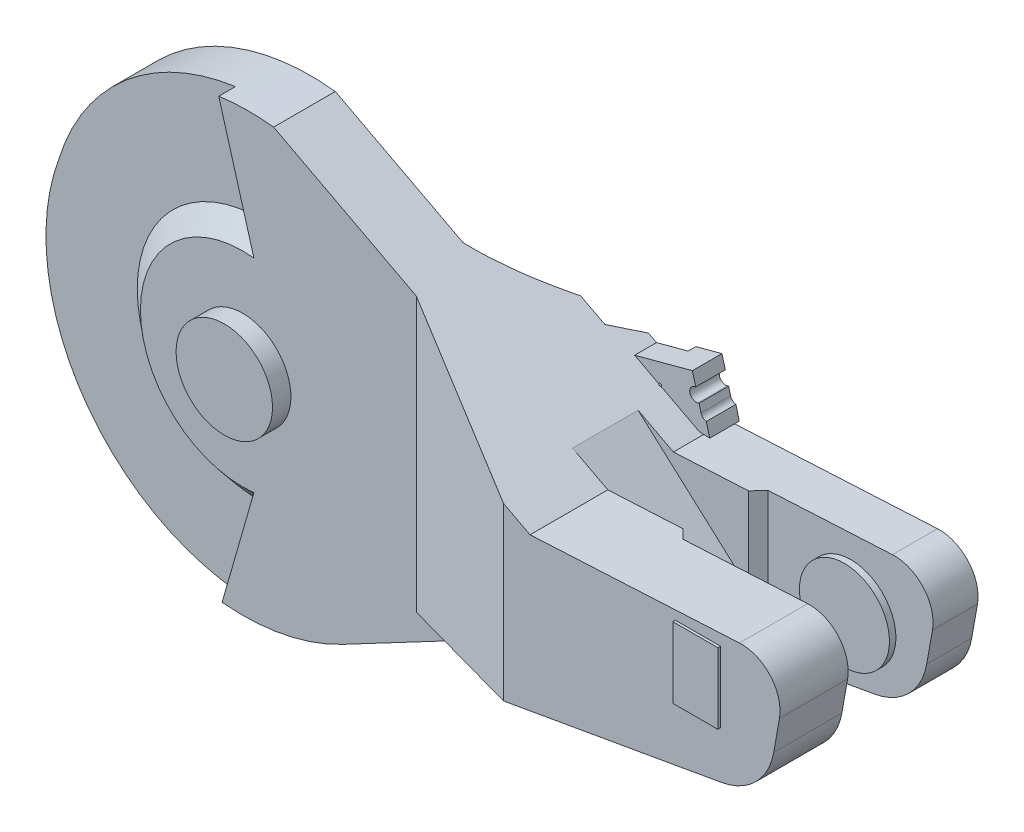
ISO-10303-21;
HEADER;
FILE_DESCRIPTION(('STEP AP214'),'2;1');
FILE_NAME('part.step','',(''),(''),'','','');
FILE_SCHEMA(('AUTOMOTIVE_DESIGN { 1 0 10303 214 1 1 1 1 }'));
ENDSEC;
DATA;
#1=APPLICATION_CONTEXT('core data for automotive mechanical design processes');
#2=APPLICATION_PROTOCOL_DEFINITION('international standard','automotive_design',2000,#1);
#3=PRODUCT_CONTEXT('',#1,'mechanical');
#4=PRODUCT('Part','Part','',(#3));
#5=PRODUCT_RELATED_PRODUCT_CATEGORY('part','',(#4));
#6=PRODUCT_DEFINITION_FORMATION('','',#4);
#7=PRODUCT_DEFINITION_CONTEXT('part definition',#1,'design');
#8=PRODUCT_DEFINITION('design','',#6,#7);
#9=PRODUCT_DEFINITION_SHAPE('','',#8);
#10=(LENGTH_UNIT() NAMED_UNIT(*) SI_UNIT(.MILLI.,.METRE.));
#11=(NAMED_UNIT(*) PLANE_ANGLE_UNIT() SI_UNIT($,.RADIAN.));
#12=(NAMED_UNIT(*) SI_UNIT($,.STERADIAN.) SOLID_ANGLE_UNIT());
#13=UNCERTAINTY_MEASURE_WITH_UNIT(LENGTH_MEASURE(1.E-05),#10,'distance_accuracy_value','');
#14=(GEOMETRIC_REPRESENTATION_CONTEXT(3) GLOBAL_UNCERTAINTY_ASSIGNED_CONTEXT((#13)) GLOBAL_UNIT_ASSIGNED_CONTEXT((#10,
#11,#12)) REPRESENTATION_CONTEXT('',''));
#15=CARTESIAN_POINT('',(0.,0.,0.));
#16=DIRECTION('',(0.,0.,1.));
#17=DIRECTION('',(1.,0.,0.));
#18=AXIS2_PLACEMENT_3D('',#15,#16,#17);
#19=CARTESIAN_POINT('',(433.906597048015,24.5766558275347,91.));
#20=DIRECTION('',(0.,0.,1.));
#21=DIRECTION('',(1.,0.,0.));
#22=AXIS2_PLACEMENT_3D('',#19,#20,#21);
#23=PLANE('',#22);
#24=DIRECTION('',(0.984807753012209,0.173648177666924,0.));
#25=VECTOR('',#24,1.);
#26=CARTESIAN_POINT('',(135.,-96.3087100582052,91.));
#27=LINE('',#26,#25);
#28=CARTESIAN_POINT('',(248.85399525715,-76.2331788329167,91.));
#29=VERTEX_POINT('',#28);
#30=CARTESIAN_POINT('',(418.460664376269,-46.3269469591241,91.));
#31=VERTEX_POINT('',#30);
#32=EDGE_CURVE('E754',#29,#31,#27,.T.);
#33=ORIENTED_EDGE('',*,*,#32,.T.);
#34=CARTESIAN_POINT('',(409.778255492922,2.91344069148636,91.));
#35=DIRECTION('',(0.,0.,1.));
#36=DIRECTION('',(1.,0.,0.));
#37=AXIS2_PLACEMENT_3D('',#34,#35,#36);
#38=CIRCLE('',#37,50.);
#39=CARTESIAN_POINT('',(459.018643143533,-5.76896819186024,91.));
#40=VERTEX_POINT('',#39);
#41=EDGE_CURVE('E703',#31,#40,#38,.T.);
#42=ORIENTED_EDGE('',*,*,#41,.T.);
#43=DIRECTION('',(0.173648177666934,0.984807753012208,0.));
#44=VECTOR('',#43,1.);
#45=CARTESIAN_POINT('',(452.939154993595,-40.2474588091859,91.));
#46=LINE('',#45,#44);
#47=CARTESIAN_POINT('',(463.450829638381,19.3672104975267,91.));
#48=VERTEX_POINT('',#47);
#49=EDGE_CURVE('E907',#40,#48,#46,.T.);
#50=ORIENTED_EDGE('',*,*,#49,.T.);
#51=CARTESIAN_POINT('',(433.906597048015,24.5766558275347,91.));
#52=DIRECTION('',(0.,0.,1.));
#53=DIRECTION('',(1.,0.,0.));
#54=AXIS2_PLACEMENT_3D('',#51,#52,#53);
#55=CIRCLE('',#54,30.);
#56=CARTESIAN_POINT('',(432.336518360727,54.5355418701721,91.));
#57=VERTEX_POINT('',#56);
#58=EDGE_CURVE('E908',#48,#57,#55,.T.);
#59=ORIENTED_EDGE('',*,*,#58,.T.);
#60=DIRECTION('',(-0.998629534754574,-0.0523359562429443,0.));
#61=VECTOR('',#60,1.);
#62=CARTESIAN_POINT('',(432.336518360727,54.5355418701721,91.));
#63=LINE('',#62,#61);
#64=CARTESIAN_POINT('',(269.46867723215,46.,91.));
#65=VERTEX_POINT('',#64);
#66=EDGE_CURVE('E770',#57,#65,#63,.T.);
#67=ORIENTED_EDGE('',*,*,#66,.T.);
#68=DIRECTION('',(-0.88536896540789,0.464889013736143,0.));
#69=VECTOR('',#68,1.);
#70=CARTESIAN_POINT('',(176.495697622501,94.818197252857,91.));
#71=LINE('',#70,#69);
#72=CARTESIAN_POINT('',(248.853995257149,56.8243450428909,91.));
#73=VERTEX_POINT('',#72);
#74=EDGE_CURVE('E784',#65,#73,#71,.T.);
#75=ORIENTED_EDGE('',*,*,#74,.T.);
#76=DIRECTION('',(0.,-1.,0.));
#77=VECTOR('',#76,1.);
#78=CARTESIAN_POINT('',(248.85399525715,-96.3087100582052,91.));
#79=LINE('',#78,#77);
#80=EDGE_CURVE('E746',#73,#29,#79,.T.);
#81=ORIENTED_EDGE('',*,*,#80,.T.);
#82=EDGE_LOOP('',(#33,#42,#50,#59,#67,#75,#81));
#83=FACE_BOUND('',#82,.T.);
#84=DIRECTION('',(-1.,0.,0.));
#85=VECTOR('',#84,1.);
#86=CARTESIAN_POINT('',(382.5,44.9999999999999,91.));
#87=LINE('',#86,#85);
#88=CARTESIAN_POINT('',(417.5,44.9999999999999,91.));
#89=VERTEX_POINT('',#88);
#90=CARTESIAN_POINT('',(382.5,44.9999999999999,91.));
#91=VERTEX_POINT('',#90);
#92=EDGE_CURVE('E357',#89,#91,#87,.T.);
#93=ORIENTED_EDGE('',*,*,#92,.F.);
#94=DIRECTION('',(0.,1.,0.));
#95=VECTOR('',#94,1.);
#96=CARTESIAN_POINT('',(417.5,44.9999999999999,91.));
#97=LINE('',#96,#95);
#98=CARTESIAN_POINT('',(417.5,-10.,91.));
#99=VERTEX_POINT('',#98);
#100=EDGE_CURVE('E368',#99,#89,#97,.T.);
#101=ORIENTED_EDGE('',*,*,#100,.F.);
#102=DIRECTION('',(1.,0.,0.));
#103=VECTOR('',#102,1.);
#104=CARTESIAN_POINT('',(382.5,-10.,91.));
#105=LINE('',#104,#103);
#106=CARTESIAN_POINT('',(382.5,-10.,91.));
#107=VERTEX_POINT('',#106);
#108=EDGE_CURVE('E378',#107,#99,#105,.T.);
#109=ORIENTED_EDGE('',*,*,#108,.F.);
#110=DIRECTION('',(0.,-1.,0.));
#111=VECTOR('',#110,1.);
#112=CARTESIAN_POINT('',(382.5,44.9999999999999,91.));
#113=LINE('',#112,#111);
#114=EDGE_CURVE('E376',#91,#107,#113,.T.);
#115=ORIENTED_EDGE('',*,*,#114,.F.);
#116=EDGE_LOOP('',(#93,#101,#109,#115));
#117=FACE_BOUND('',#116,.T.);
#118=ADVANCED_FACE('F15',(#83,#117),#23,.T.);
#119=CARTESIAN_POINT('',(0.,0.,45.));
#120=DIRECTION('',(0.,0.,-1.));
#121=DIRECTION('',(-1.,0.,0.));
#122=AXIS2_PLACEMENT_3D('',#119,#120,#121);
#123=PLANE('',#122);
#124=DIRECTION('',(0.,-1.,0.));
#125=VECTOR('',#124,1.);
#126=CARTESIAN_POINT('',(135.,-96.3087100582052,45.));
#127=LINE('',#126,#125);
#128=CARTESIAN_POINT('',(135.,116.606733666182,45.));
#129=VERTEX_POINT('',#128);
#130=CARTESIAN_POINT('',(135.,-96.3087100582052,45.));
#131=VERTEX_POINT('',#130);
#132=EDGE_CURVE('E757',#129,#131,#127,.T.);
#133=ORIENTED_EDGE('',*,*,#132,.F.);
#134=DIRECTION('',(-0.885368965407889,0.464889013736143,0.));
#135=VECTOR('',#134,1.);
#136=CARTESIAN_POINT('',(269.46867723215,46.,45.));
#137=LINE('',#136,#135);
#138=CARTESIAN_POINT('',(24.0494383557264,174.864589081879,45.));
#139=VERTEX_POINT('',#138);
#140=EDGE_CURVE('E676',#129,#139,#137,.T.);
#141=ORIENTED_EDGE('',*,*,#140,.T.);
#142=CARTESIAN_POINT('',(4.89290463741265,7.87838391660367,45.));
#143=DIRECTION('',(0.,0.,-1.));
#144=DIRECTION('',(-1.,0.,0.));
#145=AXIS2_PLACEMENT_3D('',#142,#143,#144);
#146=CIRCLE('',#145,168.081425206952);
#147=CARTESIAN_POINT('',(-18.6042727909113,174.309294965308,45.));
#148=VERTEX_POINT('',#147);
#149=EDGE_CURVE('E895',#148,#139,#146,.T.);
#150=ORIENTED_EDGE('',*,*,#149,.F.);
#151=DIRECTION('',(0.275637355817,-0.961261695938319,0.));
#152=VECTOR('',#151,1.);
#153=CARTESIAN_POINT('',(-16.,165.227116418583,45.));
#154=LINE('',#153,#152);
#155=CARTESIAN_POINT('',(8.71723441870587,79.0278760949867,45.));
#156=VERTEX_POINT('',#155);
#157=EDGE_CURVE('E915',#148,#156,#154,.T.);
#158=ORIENTED_EDGE('',*,*,#157,.T.);
#159=CARTESIAN_POINT('',(0.,0.,45.));
#160=DIRECTION('',(0.,0.,-1.));
#161=DIRECTION('',(-1.,0.,0.));
#162=AXIS2_PLACEMENT_3D('',#159,#160,#161);
#163=CIRCLE('',#162,79.5072032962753);
#164=CARTESIAN_POINT('',(8.71723441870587,-79.0278760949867,45.));
#165=VERTEX_POINT('',#164);
#166=EDGE_CURVE('E545',#165,#156,#163,.T.);
#167=ORIENTED_EDGE('',*,*,#166,.F.);
#168=DIRECTION('',(-0.275637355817,-0.961261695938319,0.));
#169=VECTOR('',#168,1.);
#170=CARTESIAN_POINT('',(8.71723441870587,-79.0278760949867,45.));
#171=LINE('',#170,#169);
#172=CARTESIAN_POINT('',(-16.,-165.227116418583,45.));
#173=VERTEX_POINT('',#172);
#174=EDGE_CURVE('E911',#165,#173,#171,.T.);
#175=ORIENTED_EDGE('',*,*,#174,.T.);
#176=CARTESIAN_POINT('',(0.,0.,45.));
#177=DIRECTION('',(0.,0.,1.));
#178=DIRECTION('',(1.,0.,0.));
#179=AXIS2_PLACEMENT_3D('',#176,#177,#178);
#180=CIRCLE('',#179,166.);
#181=CARTESIAN_POINT('',(77.7295013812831,-146.676939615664,45.));
#182=VERTEX_POINT('',#181);
#183=EDGE_CURVE('E913',#173,#182,#180,.T.);
#184=ORIENTED_EDGE('',*,*,#183,.T.);
#185=DIRECTION('',(0.884035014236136,0.4674206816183,0.));
#186=VECTOR('',#185,1.);
#187=CARTESIAN_POINT('',(192.,-86.258072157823,45.));
#188=LINE('',#187,#186);
#189=CARTESIAN_POINT('',(192.,-86.258072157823,45.));
#190=VERTEX_POINT('',#189);
#191=EDGE_CURVE('E673',#182,#190,#188,.T.);
#192=ORIENTED_EDGE('',*,*,#191,.T.);
#193=DIRECTION('',(0.984807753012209,0.173648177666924,0.));
#194=VECTOR('',#193,1.);
#195=CARTESIAN_POINT('',(135.,-96.3087100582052,45.));
#196=LINE('',#195,#194);
#197=EDGE_CURVE('E753',#131,#190,#196,.T.);
#198=ORIENTED_EDGE('',*,*,#197,.F.);
#199=EDGE_LOOP('',(#133,#141,#150,#158,#167,#175,#184,#192,#198));
#200=FACE_BOUND('',#199,.T.);
#201=CARTESIAN_POINT('',(0.,0.,45.));
#202=DIRECTION('',(0.,0.,-1.));
#203=DIRECTION('',(-1.,0.,0.));
#204=AXIS2_PLACEMENT_3D('',#201,#202,#203);
#205=CIRCLE('',#204,37.5);
#206=CARTESIAN_POINT('',(-37.5,0.,45.));
#207=VERTEX_POINT('',#206);
#208=EDGE_CURVE('E10',#207,#207,#205,.F.);
#209=ORIENTED_EDGE('',*,*,#208,.F.);
#210=EDGE_LOOP('',(#209));
#211=FACE_BOUND('',#210,.T.);
#212=ADVANCED_FACE('F514',(#200,#211),#123,.F.);
#213=CARTESIAN_POINT('',(269.46867723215,46.,45.));
#214=DIRECTION('',(-0.464889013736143,-0.885368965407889,0.));
#215=DIRECTION('',(0.88536896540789,-0.464889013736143,0.));
#216=AXIS2_PLACEMENT_3D('',#213,#214,#215);
#217=PLANE('',#216);
#218=DIRECTION('',(0.88536896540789,-0.464889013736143,0.));
#219=VECTOR('',#218,1.);
#220=CARTESIAN_POINT('',(269.46867723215,46.,-60.));
#221=LINE('',#220,#219);
#222=CARTESIAN_POINT('',(210.53450626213,76.9451197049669,-60.));
#223=VERTEX_POINT('',#222);
#224=CARTESIAN_POINT('',(216.843769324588,73.6322555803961,-60.));
#225=VERTEX_POINT('',#224);
#226=EDGE_CURVE('E1446',#223,#225,#221,.T.);
#227=ORIENTED_EDGE('',*,*,#226,.F.);
#228=CARTESIAN_POINT('',(212.806162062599,75.7523200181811,-63.0002));
#229=CARTESIAN_POINT('',(211.402032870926,76.4895993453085,-61.1373015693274));
#230=CARTESIAN_POINT('',(209.991103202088,77.230449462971,-59.2809229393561));
#231=CARTESIAN_POINT('',(207.154787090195,78.7197406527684,-55.5826130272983));
#232=CARTESIAN_POINT('',(205.729401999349,79.4681810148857,-53.7406804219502));
#233=CARTESIAN_POINT('',(202.863046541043,80.9732452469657,-50.0723081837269));
#234=CARTESIAN_POINT('',(201.422076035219,81.7298691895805,-48.2458686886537));
#235=CARTESIAN_POINT('',(198.52330330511,83.2519550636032,-44.6098073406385));
#236=CARTESIAN_POINT('',(197.065499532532,84.0174178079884,-42.8001870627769));
#237=CARTESIAN_POINT('',(195.598783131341,84.7875603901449,-40.9998));
#238=B_SPLINE_CURVE_WITH_KNOTS('',3,(#228,#229,#230,#231,#232,#233,#234,#235,#236,#237),
.UNSPECIFIED.,.F.,.F.,(4,2,2,2,4),(0.,7.33961538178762,14.6785504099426,22.0175506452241,
29.3572313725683),.UNSPECIFIED.);
#239=CARTESIAN_POINT('',(195.598946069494,84.7874748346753,-41.));
#240=VERTEX_POINT('',#239);
#241=EDGE_CURVE('E726',#223,#240,#238,.T.);
#242=ORIENTED_EDGE('',*,*,#241,.T.);
#243=DIRECTION('',(-0.88536896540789,0.464889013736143,0.));
#244=VECTOR('',#243,1.);
#245=CARTESIAN_POINT('',(269.46867723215,46.,-41.));
#246=LINE('',#245,#244);
#247=CARTESIAN_POINT('',(176.89857173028,94.606656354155,-41.));
#248=VERTEX_POINT('',#247);
#249=EDGE_CURVE('E835',#240,#248,#246,.T.);
#250=ORIENTED_EDGE('',*,*,#249,.T.);
#251=CARTESIAN_POINT('',(291.812783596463,34.2675698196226,-174.117716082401));
#252=CARTESIAN_POINT('',(290.488574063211,34.9628849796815,-172.355273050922));
#253=CARTESIAN_POINT('',(289.162095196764,35.6593917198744,-170.595006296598));
#254=CARTESIAN_POINT('',(286.504372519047,37.0549071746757,-167.079063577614));
#255=CARTESIAN_POINT('',(285.17312870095,37.7539158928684,-165.323387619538));
#256=CARTESIAN_POINT('',(281.171881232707,39.8548885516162,-160.063565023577));
#257=CARTESIAN_POINT('',(278.49439617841,41.2607808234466,-156.566669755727));
#258=CARTESIAN_POINT('',(273.116639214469,44.0845302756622,-149.593347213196));
#259=CARTESIAN_POINT('',(270.41636035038,45.5023911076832,-146.116926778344));
#260=CARTESIAN_POINT('',(264.991586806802,48.3508279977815,-139.188280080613));
#261=CARTESIAN_POINT('',(262.267092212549,49.7814040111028,-135.73605373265));
#262=CARTESIAN_POINT('',(256.762652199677,52.6716721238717,-128.822861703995));
#263=CARTESIAN_POINT('',(253.98242485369,54.1315122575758,-125.362182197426));
#264=CARTESIAN_POINT('',(248.391517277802,57.0671827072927,-118.472310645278));
#265=CARTESIAN_POINT('',(245.580836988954,58.5430130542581,-115.043118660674));
#266=CARTESIAN_POINT('',(239.925884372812,61.5123122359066,-108.221095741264));
#267=CARTESIAN_POINT('',(237.081616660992,63.0057786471,-104.828259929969));
#268=CARTESIAN_POINT('',(231.355044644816,66.0126837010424,-98.083750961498));
#269=CARTESIAN_POINT('',(228.472740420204,67.5261223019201,-94.7320777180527));
#270=CARTESIAN_POINT('',(222.782164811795,70.5141263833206,-88.2101355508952));
#271=CARTESIAN_POINT('',(219.97557849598,71.9878070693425,-85.0379924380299));
#272=CARTESIAN_POINT('',(214.318152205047,74.9584051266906,-78.744303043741));
#273=CARTESIAN_POINT('',(211.467312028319,76.4553226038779,-75.6227569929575));
#274=CARTESIAN_POINT('',(207.153169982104,78.7205897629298,-70.9841720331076));
#275=CARTESIAN_POINT('',(205.708522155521,79.4791445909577,-69.4449686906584));
#276=CARTESIAN_POINT('',(202.805977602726,81.0032109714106,-66.3825893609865));
#277=CARTESIAN_POINT('',(201.348080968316,81.7687224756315,-64.8594132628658));
#278=CARTESIAN_POINT('',(198.418199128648,83.3071431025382,-61.8304359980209));
#279=CARTESIAN_POINT('',(196.946213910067,84.0800522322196,-60.3246348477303));
#280=CARTESIAN_POINT('',(193.98726994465,85.6337327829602,-57.331939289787));
#281=CARTESIAN_POINT('',(192.50031133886,86.4145041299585,-55.8450447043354));
#282=CARTESIAN_POINT('',(189.515156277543,87.9819475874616,-52.8964946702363));
#283=CARTESIAN_POINT('',(188.017010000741,88.7685933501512,-51.4347744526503));
#284=CARTESIAN_POINT('',(185.003848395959,90.3507424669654,-48.533666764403));
#285=CARTESIAN_POINT('',(183.488833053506,91.1462458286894,-47.0942793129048));
#286=CARTESIAN_POINT('',(180.44074940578,92.7467317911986,-44.2398507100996));
#287=CARTESIAN_POINT('',(178.907679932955,93.5517150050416,-42.8248111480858));
#288=CARTESIAN_POINT('',(175.822435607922,95.1717132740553,-40.0215426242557));
#289=CARTESIAN_POINT('',(174.270260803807,95.9867283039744,-38.6333135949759));
#290=CARTESIAN_POINT('',(171.14662090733,97.626887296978,-35.8872331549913));
#291=CARTESIAN_POINT('',(169.575169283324,98.4520241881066,-34.529362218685));
#292=CARTESIAN_POINT('',(166.410678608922,100.113633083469,-31.8460240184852));
#293=CARTESIAN_POINT('',(164.817639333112,100.950105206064,-30.5205570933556));
#294=CARTESIAN_POINT('',(161.608903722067,102.634946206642,-27.905599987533));
#295=CARTESIAN_POINT('',(159.99321068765,103.483313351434,-26.6161046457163));
#296=CARTESIAN_POINT('',(156.737655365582,105.192738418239,-24.0767311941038));
#297=CARTESIAN_POINT('',(155.097793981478,106.053795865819,-22.8268516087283));
#298=CARTESIAN_POINT('',(151.880745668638,107.743001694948,-20.436504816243));
#299=CARTESIAN_POINT('',(150.304887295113,108.570452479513,-19.2937589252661));
#300=CARTESIAN_POINT('',(147.129174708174,110.237953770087,-17.0516350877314));
#301=CARTESIAN_POINT('',(145.529320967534,111.078004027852,-15.9522562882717));
#302=CARTESIAN_POINT('',(142.304398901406,112.771344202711,-13.8012606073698));
#303=CARTESIAN_POINT('',(140.679328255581,113.624635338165,-12.749648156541));
#304=CARTESIAN_POINT('',(137.403193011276,115.344866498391,-10.6992934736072));
#305=CARTESIAN_POINT('',(135.752128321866,116.211806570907,-9.70055142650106));
#306=CARTESIAN_POINT('',(132.424602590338,117.959021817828,-7.76221212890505));
#307=CARTESIAN_POINT('',(130.748162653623,118.839285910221,-6.82256875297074));
#308=CARTESIAN_POINT('',(127.368151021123,120.614060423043,-5.00754055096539));
#309=CARTESIAN_POINT('',(125.664579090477,121.508570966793,-4.13215628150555));
#310=CARTESIAN_POINT('',(122.230479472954,123.311745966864,-2.45219474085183));
#311=CARTESIAN_POINT('',(120.499955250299,124.220408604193,-1.647608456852));
#312=CARTESIAN_POINT('',(117.012248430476,126.051731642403,-0.11594561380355));
#313=CARTESIAN_POINT('',(115.255067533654,126.974391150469,0.611135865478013));
#314=CARTESIAN_POINT('',(112.01551221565,128.675414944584,1.86457378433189));
#315=CARTESIAN_POINT('',(110.537115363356,129.451690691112,2.40405344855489));
#316=CARTESIAN_POINT('',(107.563770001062,131.012933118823,3.42072186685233));
#317=CARTESIAN_POINT('',(106.068823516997,131.797898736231,3.89791815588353));
#318=CARTESIAN_POINT('',(103.06359146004,133.375884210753,4.7861841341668));
#319=CARTESIAN_POINT('',(101.553306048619,134.168903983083,5.197254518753));
#320=CARTESIAN_POINT('',(98.5191306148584,135.762087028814,5.94961797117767));
#321=CARTESIAN_POINT('',(96.9952405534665,136.562250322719,6.29091083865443));
#322=CARTESIAN_POINT('',(93.938628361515,138.167214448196,6.89992469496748));
#323=CARTESIAN_POINT('',(92.4059257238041,138.972005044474,7.16777015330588));
#324=CARTESIAN_POINT('',(89.3316380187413,140.586250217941,7.62793533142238));
#325=CARTESIAN_POINT('',(87.7900529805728,141.395704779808,7.8202552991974));
#326=CARTESIAN_POINT('',(84.7008285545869,143.017792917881,8.1273204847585));
#327=CARTESIAN_POINT('',(83.1531891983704,143.830426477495,8.24206610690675));
#328=CARTESIAN_POINT('',(80.0548959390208,145.457276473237,8.39272188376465));
#329=CARTESIAN_POINT('',(78.5042420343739,146.271492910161,8.42863199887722));
#330=CARTESIAN_POINT('',(75.3989247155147,147.902031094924,8.42120498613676));
#331=CARTESIAN_POINT('',(73.8442616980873,148.718352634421,8.37765512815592));
#332=CARTESIAN_POINT('',(70.738268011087,150.349245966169,8.21138136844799));
#333=CARTESIAN_POINT('',(69.1869373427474,151.163817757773,8.08865743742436));
#334=CARTESIAN_POINT('',(66.0906623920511,152.789607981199,7.76538962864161));
#335=CARTESIAN_POINT('',(64.545718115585,153.600826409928,7.56484567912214));
#336=CARTESIAN_POINT('',(61.4650306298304,155.218431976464,7.08807658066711));
#337=CARTESIAN_POINT('',(59.9292874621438,156.024819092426,6.81185108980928));
#338=CARTESIAN_POINT('',(56.8678029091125,157.632341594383,6.18617682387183));
#339=CARTESIAN_POINT('',(55.3420745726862,158.433470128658,5.83664681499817));
#340=CARTESIAN_POINT('',(52.3044969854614,160.028439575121,5.06789563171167));
#341=CARTESIAN_POINT('',(50.7926476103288,160.822280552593,4.64867508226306));
#342=CARTESIAN_POINT('',(47.7844211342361,162.401838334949,3.74421864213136));
#343=CARTESIAN_POINT('',(46.28804516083,163.187554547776,3.25897797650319));
#344=CARTESIAN_POINT('',(43.3121408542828,164.750140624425,2.2264330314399));
#345=CARTESIAN_POINT('',(41.8326136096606,165.527009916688,1.6791247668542));
#346=CARTESIAN_POINT('',(38.1051864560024,167.484205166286,0.218368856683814));
#347=CARTESIAN_POINT('',(35.8693115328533,168.658217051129,-0.734410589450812));
#348=CARTESIAN_POINT('',(31.4413830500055,170.983231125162,-2.76216539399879));
#349=CARTESIAN_POINT('',(29.2493355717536,172.134230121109,-3.83715757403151));
#350=CARTESIAN_POINT('',(24.9083824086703,174.413575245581,-6.09610719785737));
#351=CARTESIAN_POINT('',(22.759501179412,175.541908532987,-7.28012439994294));
#352=CARTESIAN_POINT('',(18.5054465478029,177.775625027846,-9.74388751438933));
#353=CARTESIAN_POINT('',(16.4002717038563,178.881008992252,-11.0236302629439));
#354=CARTESIAN_POINT('',(12.21293920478,181.079691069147,-13.679593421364));
#355=CARTESIAN_POINT('',(10.1311681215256,182.172786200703,-15.0565891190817));
#356=CARTESIAN_POINT('',(6.00840361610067,184.337564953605,-17.8861919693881));
#357=CARTESIAN_POINT('',(3.9674103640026,185.409248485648,-19.3387994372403));
#358=CARTESIAN_POINT('',(-0.0753692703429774,187.532028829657,-22.3100392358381));
#359=CARTESIAN_POINT('',(-2.07717014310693,188.583133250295,-23.8286464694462));
#360=CARTESIAN_POINT('',(-6.04480440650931,190.666456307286,-26.9245839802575));
#361=CARTESIAN_POINT('',(-8.01063740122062,191.698674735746,-28.5019149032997));
#362=CARTESIAN_POINT('',(-12.3308830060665,193.967146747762,-32.0557325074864));
#363=CARTESIAN_POINT('',(-14.6772520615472,195.199176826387,-34.0446861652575));
#364=CARTESIAN_POINT('',(-19.3247108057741,197.639461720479,-38.0891415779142));
#365=CARTESIAN_POINT('',(-21.6257975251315,198.847714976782,-40.1446476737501));
#366=CARTESIAN_POINT('',(-26.1871032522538,201.242762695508,-44.3139408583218));
#367=CARTESIAN_POINT('',(-28.4473117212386,202.429551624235,-46.4277426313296));
#368=CARTESIAN_POINT('',(-32.9298744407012,204.783253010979,-50.7057649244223));
#369=CARTESIAN_POINT('',(-35.1522294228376,205.950165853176,-52.8699844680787));
#370=CARTESIAN_POINT('',(-39.5665960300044,208.268058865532,-57.2468073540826));
#371=CARTESIAN_POINT('',(-41.7585430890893,209.419005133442,-59.4594936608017));
#372=CARTESIAN_POINT('',(-46.1108855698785,211.704330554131,-63.9240814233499));
#373=CARTESIAN_POINT('',(-48.2712808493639,212.838709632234,-66.1759830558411));
#374=CARTESIAN_POINT('',(-52.5629694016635,215.092186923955,-70.7142296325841));
#375=CARTESIAN_POINT('',(-54.6942664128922,216.211287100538,-73.0005700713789));
#376=CARTESIAN_POINT('',(-58.9305018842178,218.435647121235,-77.6041568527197));
#377=CARTESIAN_POINT('',(-61.035440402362,219.540906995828,-79.9214031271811));
#378=CARTESIAN_POINT('',(-65.118241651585,221.684701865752,-84.4688815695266));
#379=CARTESIAN_POINT('',(-67.0972627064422,222.72384507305,-86.6977882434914));
#380=CARTESIAN_POINT('',(-71.0351878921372,224.791568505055,-91.1781423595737));
#381=CARTESIAN_POINT('',(-72.9940920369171,225.820148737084,-93.4295897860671));
#382=CARTESIAN_POINT('',(-76.8934168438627,227.867603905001,-97.9529917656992));
#383=CARTESIAN_POINT('',(-78.8338366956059,228.886478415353,-100.22494720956));
#384=CARTESIAN_POINT('',(-82.6975108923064,230.915214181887,-104.787404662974));
#385=CARTESIAN_POINT('',(-84.6207651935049,231.925075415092,-107.077906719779));
#386=CARTESIAN_POINT('',(-88.4425238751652,233.93180220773,-111.665185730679));
#387=CARTESIAN_POINT('',(-90.3411015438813,234.928706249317,-113.961884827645));
#388=CARTESIAN_POINT('',(-94.1236376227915,236.914838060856,-118.570593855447));
#389=CARTESIAN_POINT('',(-96.007596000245,237.904065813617,-120.88260382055));
#390=CARTESIAN_POINT('',(-99.7616600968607,239.875247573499,-125.520323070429));
#391=CARTESIAN_POINT('',(-101.631767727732,240.85720258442,-127.846030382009));
#392=CARTESIAN_POINT('',(-105.359300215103,242.814453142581,-132.510336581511));
#393=CARTESIAN_POINT('',(-107.216725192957,243.789748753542,-134.848935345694));
#394=CARTESIAN_POINT('',(-109.068277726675,244.761960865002,-137.193437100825));
#395=B_SPLINE_CURVE_WITH_KNOTS('',3,(#251,#252,#253,#254,#255,#256,#257,#258,#259,#260,#261,
#262,#263,#264,#265,#266,#267,#268,#269,#270,#271,#272,#273,#274,#275,#276,#277,#278,#279,#280,
#281,#282,#283,#284,#285,#286,#287,#288,#289,#290,#291,#292,#293,#294,#295,#296,#297,#298,#299,
#300,#301,#302,#303,#304,#305,#306,#307,#308,#309,#310,#311,#312,#313,#314,#315,#316,#317,#318,
#319,#320,#321,#322,#323,#324,#325,#326,#327,#328,#329,#330,#331,#332,#333,#334,#335,#336,#337,
#338,#339,#340,#341,#342,#343,#344,#345,#346,#347,#348,#349,#350,#351,#352,#353,#354,#355,#356,
#357,#358,#359,#360,#361,#362,#363,#364,#365,#366,#367,#368,#369,#370,#371,#372,#373,#374,#375,
#376,#377,#378,#379,#380,#381,#382,#383,#384,#385,#386,#387,#388,#389,#390,#391,#392,#393,#394),
.UNSPECIFIED.,.F.,.F.,(4,2,2,2,2,2,2,2,2,2,2,2,2,2,2,2,2,2,2,2,2,2,2,2,2,2,2,2,2,2,2,2,2,2,2,2,
2,2,2,2,2,2,2,2,2,2,2,2,2,2,2,2,2,2,2,2,2,2,2,2,2,2,2,2,2,2,2,2,2,2,2,4),(0.,6.93460377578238,
13.8692174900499,27.7386262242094,41.6124316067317,55.4861881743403,69.5050366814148,
83.5239123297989,97.5408834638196,111.557825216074,125.010995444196,138.464226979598,
145.193480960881,151.92268834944,158.651902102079,165.381052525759,172.088997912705,
178.796949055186,185.505336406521,192.21370687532,198.917630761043,205.621624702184,
212.324651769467,219.027428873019,225.372324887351,231.71709605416,238.0624545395,
244.407835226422,250.748200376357,257.088620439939,263.428232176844,269.767441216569,
275.030713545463,280.29334853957,285.55592819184,290.818522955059,296.072143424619,
301.32574664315,306.579322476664,311.832900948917,317.100564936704,322.36823087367,
327.635901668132,332.903596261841,338.177159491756,343.450675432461,348.724572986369,
353.99880935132,362.092343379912,370.186992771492,378.286105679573,386.384951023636,
394.557863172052,402.73080940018,410.900674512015,419.070629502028,429.009874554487,
438.94976921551,448.892190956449,458.834420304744,468.795255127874,478.75613483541,
488.715722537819,498.675288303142,508.145029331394,517.614763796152,527.084911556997,
536.555083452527,545.981510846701,555.407959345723,564.833081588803,574.258113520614),.UNSPECIFIED.);
#396=CARTESIAN_POINT('',(123.346772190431,122.725603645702,-2.99999999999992));
#397=VERTEX_POINT('',#396);
#398=EDGE_CURVE('E873',#248,#397,#395,.T.);
#399=ORIENTED_EDGE('',*,*,#398,.T.);
#400=DIRECTION('',(-0.885368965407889,0.464889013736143,0.));
#401=VECTOR('',#400,1.);
#402=CARTESIAN_POINT('',(24.0494383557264,174.864589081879,-3.));
#403=LINE('',#402,#401);
#404=CARTESIAN_POINT('',(24.0494383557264,174.864589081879,-3.));
#405=VERTEX_POINT('',#404);
#406=EDGE_CURVE('E885',#397,#405,#403,.T.);
#407=ORIENTED_EDGE('',*,*,#406,.T.);
#408=DIRECTION('',(0.,0.,-1.));
#409=VECTOR('',#408,1.);
#410=CARTESIAN_POINT('',(24.0494383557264,174.864589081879,305.946692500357));
#411=LINE('',#410,#409);
#412=EDGE_CURVE('E892',#139,#405,#411,.T.);
#413=ORIENTED_EDGE('',*,*,#412,.F.);
#414=ORIENTED_EDGE('',*,*,#140,.F.);
#415=DIRECTION('',(-0.833638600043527,0.437726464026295,-0.336811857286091));
#416=VECTOR('',#415,1.);
#417=CARTESIAN_POINT('',(92.6651217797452,138.83590653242,27.8955989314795));
#418=LINE('',#417,#416);
#419=EDGE_CURVE('E939',#73,#129,#418,.T.);
#420=ORIENTED_EDGE('',*,*,#419,.F.);
#421=ORIENTED_EDGE('',*,*,#74,.F.);
#422=DIRECTION('',(0.,0.,-1.));
#423=VECTOR('',#422,1.);
#424=CARTESIAN_POINT('',(269.46867723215,46.,45.));
#425=LINE('',#424,#423);
#426=CARTESIAN_POINT('',(269.46867723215,46.,30.5));
#427=VERTEX_POINT('',#426);
#428=EDGE_CURVE('E670',#65,#427,#425,.T.);
#429=ORIENTED_EDGE('',*,*,#428,.T.);
#430=DIRECTION('',(0.885368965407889,-0.464889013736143,0.));
#431=VECTOR('',#430,1.);
#432=CARTESIAN_POINT('',(242.030669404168,60.4071329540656,30.5));
#433=LINE('',#432,#431);
#434=CARTESIAN_POINT('',(242.030669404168,60.4071329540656,30.5));
#435=VERTEX_POINT('',#434);
#436=EDGE_CURVE('E781',#435,#427,#433,.T.);
#437=ORIENTED_EDGE('',*,*,#436,.F.);
#438=DIRECTION('',(0.,0.,-1.));
#439=VECTOR('',#438,1.);
#440=CARTESIAN_POINT('',(242.030669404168,60.4071329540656,38.));
#441=LINE('',#440,#439);
#442=CARTESIAN_POINT('',(242.030669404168,60.4071329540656,-20.5));
#443=VERTEX_POINT('',#442);
#444=EDGE_CURVE('E831',#435,#443,#441,.T.);
#445=ORIENTED_EDGE('',*,*,#444,.T.);
#446=DIRECTION('',(-0.885368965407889,0.464889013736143,0.));
#447=VECTOR('',#446,1.);
#448=CARTESIAN_POINT('',(269.46867723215,46.,-20.5));
#449=LINE('',#448,#447);
#450=CARTESIAN_POINT('',(269.46867723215,46.,-20.5));
#451=VERTEX_POINT('',#450);
#452=EDGE_CURVE('E953',#451,#443,#449,.T.);
#453=ORIENTED_EDGE('',*,*,#452,.F.);
#454=CARTESIAN_POINT('',(269.46867723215,46.,-63.));
#455=VERTEX_POINT('',#454);
#456=EDGE_CURVE('E675',#451,#455,#425,.T.);
#457=ORIENTED_EDGE('',*,*,#456,.T.);
#458=DIRECTION('',(0.885368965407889,-0.464889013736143,0.));
#459=VECTOR('',#458,1.);
#460=CARTESIAN_POINT('',(77.1715762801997,146.97124825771,-63.));
#461=LINE('',#460,#459);
#462=CARTESIAN_POINT('',(266.956653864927,47.3190117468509,-63.));
#463=VERTEX_POINT('',#462);
#464=EDGE_CURVE('E765',#463,#455,#461,.T.);
#465=ORIENTED_EDGE('',*,*,#464,.F.);
#466=DIRECTION('',(0.,0.,1.));
#467=VECTOR('',#466,1.);
#468=CARTESIAN_POINT('',(266.956653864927,47.3190117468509,45.));
#469=LINE('',#468,#467);
#470=CARTESIAN_POINT('',(266.956653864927,47.3190117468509,-43.));
#471=VERTEX_POINT('',#470);
#472=EDGE_CURVE('E971',#463,#471,#469,.T.);
#473=ORIENTED_EDGE('',*,*,#472,.T.);
#474=DIRECTION('',(-0.885368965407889,0.464889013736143,0.));
#475=VECTOR('',#474,1.);
#476=CARTESIAN_POINT('',(269.46867723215,46.,-43.));
#477=LINE('',#476,#475);
#478=CARTESIAN_POINT('',(237.605662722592,62.7306128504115,-43.));
#479=VERTEX_POINT('',#478);
#480=EDGE_CURVE('E706',#471,#479,#477,.T.);
#481=ORIENTED_EDGE('',*,*,#480,.T.);
#482=CARTESIAN_POINT('',(240.560041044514,61.1793296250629,-45.0002));
#483=CARTESIAN_POINT('',(240.239160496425,61.3478173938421,-44.7825814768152));
#484=CARTESIAN_POINT('',(239.918278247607,61.5163060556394,-44.5649661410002));
#485=CARTESIAN_POINT('',(239.436868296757,61.7690845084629,-44.2386048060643));
#486=CARTESIAN_POINT('',(239.276364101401,61.8533619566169,-44.129814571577));
#487=CARTESIAN_POINT('',(238.955332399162,62.021929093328,-43.9122774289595));
#488=CARTESIAN_POINT('',(238.794804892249,62.1062187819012,-43.8035305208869));
#489=CARTESIAN_POINT('',(238.468196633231,62.277714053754,-43.5823924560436));
#490=CARTESIAN_POINT('',(238.302114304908,62.3649204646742,-43.4700042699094));
#491=CARTESIAN_POINT('',(237.969852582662,62.5393842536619,-43.2454122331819));
#492=CARTESIAN_POINT('',(237.803673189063,62.6266416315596,-43.1332083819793));
#493=CARTESIAN_POINT('',(237.551135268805,62.7592440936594,-42.9633104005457));
#494=CARTESIAN_POINT('',(237.464892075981,62.8045286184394,-42.9053979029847));
#495=CARTESIAN_POINT('',(237.335356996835,62.8725448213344,-42.8188128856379));
#496=CARTESIAN_POINT('',(237.292142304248,62.8952359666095,-42.789993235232));
#497=CARTESIAN_POINT('',(237.205624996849,62.9406644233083,-42.7325246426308));
#498=CARTESIAN_POINT('',(237.162322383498,62.9634017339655,-42.7038756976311));
#499=CARTESIAN_POINT('',(237.073596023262,63.0099901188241,-42.6455863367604));
#500=CARTESIAN_POINT('',(237.028165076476,63.0338449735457,-42.6159598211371));
#501=CARTESIAN_POINT('',(236.959750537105,63.0697680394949,-42.5721040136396));
#502=CARTESIAN_POINT('',(236.936911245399,63.081760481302,-42.5575890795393));
#503=CARTESIAN_POINT('',(236.8910737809,63.1058287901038,-42.5288899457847));
#504=CARTESIAN_POINT('',(236.868075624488,63.1179046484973,-42.5147057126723));
#505=CARTESIAN_POINT('',(236.819650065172,63.1433319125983,-42.4856099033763));
#506=CARTESIAN_POINT('',(236.794195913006,63.1566973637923,-42.4707536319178));
#507=CARTESIAN_POINT('',(236.755452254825,63.1770408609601,-42.4496065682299));
#508=CARTESIAN_POINT('',(236.742415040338,63.1838864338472,-42.442733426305));
#509=CARTESIAN_POINT('',(236.716087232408,63.1977106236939,-42.4296436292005));
#510=CARTESIAN_POINT('',(236.702796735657,63.2046891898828,-42.423426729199));
#511=CARTESIAN_POINT('',(236.67354331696,63.2200495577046,-42.4110901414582));
#512=CARTESIAN_POINT('',(236.657511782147,63.2284673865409,-42.4051685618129));
#513=CARTESIAN_POINT('',(236.624958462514,63.2455604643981,-42.3961549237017));
#514=CARTESIAN_POINT('',(236.608444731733,63.2542314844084,-42.3930301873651));
#515=CARTESIAN_POINT('',(236.583392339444,63.2673859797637,-42.3913603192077));
#516=CARTESIAN_POINT('',(236.574930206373,63.2718292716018,-42.3913178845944));
#517=CARTESIAN_POINT('',(236.558051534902,63.2806919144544,-42.3922600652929));
#518=CARTESIAN_POINT('',(236.549635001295,63.2851112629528,-42.393244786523));
#519=CARTESIAN_POINT('',(236.532836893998,63.2939316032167,-42.3961303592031));
#520=CARTESIAN_POINT('',(236.524456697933,63.2983318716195,-42.3980410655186));
#521=CARTESIAN_POINT('',(236.507853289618,63.307049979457,-42.4025851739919));
#522=CARTESIAN_POINT('',(236.499630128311,63.3113677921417,-42.4052188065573));
#523=CARTESIAN_POINT('',(236.477751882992,63.3228556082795,-42.4130052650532));
#524=CARTESIAN_POINT('',(236.464235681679,63.3299526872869,-42.418647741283));
#525=CARTESIAN_POINT('',(236.43751740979,63.343981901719,-42.4308221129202));
#526=CARTESIAN_POINT('',(236.424315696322,63.3509138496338,-42.437354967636));
#527=CARTESIAN_POINT('',(236.384966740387,63.3715751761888,-42.4577679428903));
#528=CARTESIAN_POINT('',(236.359142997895,63.3851346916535,-42.4724338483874));
#529=CARTESIAN_POINT('',(236.307770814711,63.4121091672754,-42.5026869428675));
#530=CARTESIAN_POINT('',(236.282224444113,63.4255230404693,-42.5182784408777));
#531=CARTESIAN_POINT('',(236.23139796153,63.4522109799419,-42.5498835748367));
#532=CARTESIAN_POINT('',(236.206117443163,63.4654852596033,-42.5658963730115));
#533=CARTESIAN_POINT('',(236.131090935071,63.504880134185,-42.6138934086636));
#534=CARTESIAN_POINT('',(236.08152221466,63.5309076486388,-42.6462283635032));
#535=CARTESIAN_POINT('',(235.982576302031,63.5828621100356,-42.7112733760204));
#536=CARTESIAN_POINT('',(235.933199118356,63.6087890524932,-42.7439834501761));
#537=CARTESIAN_POINT('',(235.834510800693,63.6606082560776,-42.8096271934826));
#538=CARTESIAN_POINT('',(235.785199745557,63.6865004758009,-42.8425610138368));
#539=CARTESIAN_POINT('',(235.686637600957,63.7382534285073,-42.9085405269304));
#540=CARTESIAN_POINT('',(235.63738651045,63.7641141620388,-42.9415862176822));
#541=CARTESIAN_POINT('',(235.490291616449,63.8413506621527,-43.0404204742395));
#542=CARTESIAN_POINT('',(235.392501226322,63.8926983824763,-43.1063104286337));
#543=CARTESIAN_POINT('',(235.197009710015,63.9953469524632,-43.2381976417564));
#544=CARTESIAN_POINT('',(235.099308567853,64.0466478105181,-43.3041948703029));
#545=CARTESIAN_POINT('',(234.802013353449,64.2027514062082,-43.505155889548));
#546=CARTESIAN_POINT('',(234.602475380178,64.3075246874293,-43.6402255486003));
#547=CARTESIAN_POINT('',(234.203433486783,64.5170533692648,-43.9104797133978));
#548=CARTESIAN_POINT('',(234.003929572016,64.6218087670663,-44.0456642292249));
#549=CARTESIAN_POINT('',(233.603016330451,64.832320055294,-44.3173968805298));
#550=CARTESIAN_POINT('',(233.401607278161,64.9380758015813,-44.4539455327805));
#551=CARTESIAN_POINT('',(232.998826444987,65.1495677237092,-44.7270611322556));
#552=CARTESIAN_POINT('',(232.79745466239,65.2553039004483,-44.8636280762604));
#553=CARTESIAN_POINT('',(232.596085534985,65.361038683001,-45.0002));
#554=B_SPLINE_CURVE_WITH_KNOTS('',3,(#482,#483,#484,#485,#486,#487,#488,#489,#490,#491,#492,
#493,#494,#495,#496,#497,#498,#499,#500,#501,#502,#503,#504,#505,#506,#507,#508,#509,#510,#511,
#512,#513,#514,#515,#516,#517,#518,#519,#520,#521,#522,#523,#524,#525,#526,#527,#528,#529,#530,
#531,#532,#533,#534,#535,#536,#537,#538,#539,#540,#541,#542,#543,#544,#545,#546,#547,#548,#549,
#550,#551,#552,#553),.UNSPECIFIED.,.F.,.F.,(4,2,2,2,2,2,2,2,2,2,2,2,2,2,2,2,2,2,2,2,2,2,2,2,2,2,
2,2,2,2,2,2,2,2,2,4),(0.,1.26822414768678,1.90249254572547,2.5367617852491,3.19279123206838,
3.8488185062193,4.18879145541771,4.35884039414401,4.52888653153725,4.70663826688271,
4.79543499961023,4.8842227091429,4.98128012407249,5.03002095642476,5.07874354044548,
5.1357910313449,5.19216294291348,5.22078024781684,5.24940050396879,5.27833227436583,
5.30727327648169,5.35604499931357,5.40486969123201,5.50276210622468,5.60115275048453,
5.69936066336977,5.89331658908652,6.08728106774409,6.28139314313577,6.47550178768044,
6.86133740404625,7.24707866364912,8.03532336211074,8.82364641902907,9.61961046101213,
10.4154944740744),.UNSPECIFIED.);
#555=CARTESIAN_POINT('',(235.550463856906,63.8097554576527,-42.9999999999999));
#556=VERTEX_POINT('',#555);
#557=EDGE_CURVE('E479',#479,#556,#554,.T.);
#558=ORIENTED_EDGE('',*,*,#557,.T.);
#559=CARTESIAN_POINT('',(216.843769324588,73.6322555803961,-43.));
#560=VERTEX_POINT('',#559);
#561=EDGE_CURVE('E705',#556,#560,#477,.T.);
#562=ORIENTED_EDGE('',*,*,#561,.T.);
#563=DIRECTION('',(0.,0.,-1.));
#564=VECTOR('',#563,1.);
#565=CARTESIAN_POINT('',(216.843769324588,73.6322555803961,-43.));
#566=LINE('',#565,#564);
#567=EDGE_CURVE('E987',#560,#225,#566,.T.);
#568=ORIENTED_EDGE('',*,*,#567,.T.);
#569=EDGE_LOOP('',(#227,#242,#250,#399,#407,#413,#414,#420,#421,#429,#437,#445,#453,#457,#465,
#473,#481,#558,#562,#568));
#570=FACE_BOUND('',#569,.T.);
#571=ADVANCED_FACE('F17',(#570),#217,.F.);
#572=CARTESIAN_POINT('',(0.,0.,-41.));
#573=DIRECTION('',(0.,0.,-1.));
#574=DIRECTION('',(-1.,0.,0.));
#575=AXIS2_PLACEMENT_3D('',#572,#573,#574);
#576=CONICAL_SURFACE('',#575,213.185045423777,0.5235987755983);
#577=CARTESIAN_POINT('',(0.,0.,-60.));
#578=DIRECTION('',(0.,0.,-1.));
#579=DIRECTION('',(-1.,0.,0.));
#580=AXIS2_PLACEMENT_3D('',#577,#578,#579);
#581=CIRCLE('',#580,224.15470053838);
#582=CARTESIAN_POINT('',(220.589066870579,39.8220209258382,-60.));
#583=VERTEX_POINT('',#582);
#584=EDGE_CURVE('E723',#583,#223,#581,.F.);
#585=ORIENTED_EDGE('',*,*,#584,.F.);
#586=CARTESIAN_POINT('',(-37.3267549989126,192.029507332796,-258.623665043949));
#587=DIRECTION('',(0.134922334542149,-0.694115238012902,-0.70710678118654));
#588=DIRECTION('',(-0.134922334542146,0.694115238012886,-0.707106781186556));
#589=AXIS2_PLACEMENT_3D('',#586,#587,#588);
#590=ELLIPSE('',#589,479.178160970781,276.653640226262);
#591=CARTESIAN_POINT('',(219.801876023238,37.6315731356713,-57.9999999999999));
#592=VERTEX_POINT('',#591);
#593=EDGE_CURVE('E621',#583,#592,#590,.T.);
#594=ORIENTED_EDGE('',*,*,#593,.T.);
#595=CARTESIAN_POINT('',(0.,0.,-58.));
#596=DIRECTION('',(0.,0.,1.));
#597=DIRECTION('',(1.,0.,0.));
#598=AXIS2_PLACEMENT_3D('',#595,#596,#597);
#599=CIRCLE('',#598,223.);
#600=CARTESIAN_POINT('',(206.71067833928,-83.6641826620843,-58.));
#601=VERTEX_POINT('',#600);
#602=EDGE_CURVE('E720',#601,#592,#599,.T.);
#603=ORIENTED_EDGE('',*,*,#602,.F.);
#604=CARTESIAN_POINT('',(195.203727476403,-85.6931685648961,-40.9998));
#605=CARTESIAN_POINT('',(196.168941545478,-85.5229752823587,-42.4121009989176));
#606=CARTESIAN_POINT('',(197.132495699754,-85.3530746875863,-43.8255712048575));
#607=CARTESIAN_POINT('',(199.056412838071,-85.0138361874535,-46.6547392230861));
#608=CARTESIAN_POINT('',(200.016775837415,-84.844498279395,-48.0704370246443));
#609=CARTESIAN_POINT('',(201.934448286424,-84.5063608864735,-50.9039625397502));
#610=CARTESIAN_POINT('',(202.891757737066,-84.3375614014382,-52.321790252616));
#611=CARTESIAN_POINT('',(204.803450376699,-84.0004784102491,-55.1594883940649));
#612=CARTESIAN_POINT('',(205.757833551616,-83.832194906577,-56.5793588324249));
#613=CARTESIAN_POINT('',(206.71081248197,-83.664159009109,-58.0002));
#614=B_SPLINE_CURVE_WITH_KNOTS('',3,(#604,#605,#606,#607,#608,#609,#610,#611,#612,#613),
.UNSPECIFIED.,.F.,.F.,(4,2,2,2,4),(0.,5.15720503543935,10.3143853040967,15.4715639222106,
20.6287673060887),.UNSPECIFIED.);
#615=CARTESIAN_POINT('',(195.203864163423,-85.6931444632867,-41.));
#616=VERTEX_POINT('',#615);
#617=EDGE_CURVE('E605',#616,#601,#614,.T.);
#618=ORIENTED_EDGE('',*,*,#617,.F.);
#619=CARTESIAN_POINT('',(0.,0.,-41.));
#620=DIRECTION('',(0.,0.,1.));
#621=DIRECTION('',(1.,0.,0.));
#622=AXIS2_PLACEMENT_3D('',#619,#620,#621);
#623=CIRCLE('',#622,213.185045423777);
#624=EDGE_CURVE('E725',#616,#240,#623,.T.);
#625=ORIENTED_EDGE('',*,*,#624,.T.);
#626=ORIENTED_EDGE('',*,*,#241,.F.);
#627=EDGE_LOOP('',(#585,#594,#603,#618,#625,#626));
#628=FACE_BOUND('',#627,.T.);
#629=ADVANCED_FACE('F502',(#628),#576,.F.);
#630=CARTESIAN_POINT('',(236.651827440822,63.4106660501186,-63.));
#631=DIRECTION('',(0.,0.,-1.));
#632=DIRECTION('',(-1.,0.,0.));
#633=AXIS2_PLACEMENT_3D('',#630,#631,#632);
#634=CYLINDRICAL_SURFACE('',#633,5.);
#635=CARTESIAN_POINT('',(236.651827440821,63.4106660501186,-50.));
#636=DIRECTION('',(0.,0.,-1.));
#637=DIRECTION('',(-1.,0.,0.));
#638=AXIS2_PLACEMENT_3D('',#635,#636,#637);
#639=CIRCLE('',#638,5.);
#640=CARTESIAN_POINT('',(231.651827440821,63.4106660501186,-50.));
#641=VERTEX_POINT('',#640);
#642=EDGE_CURVE('E487',#641,#641,#639,.T.);
#643=ORIENTED_EDGE('',*,*,#642,.F.);
#644=EDGE_LOOP('',(#643));
#645=FACE_BOUND('',#644,.T.);
#646=CARTESIAN_POINT('',(236.651827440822,63.4106660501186,-60.));
#647=DIRECTION('',(0.,0.,-1.));
#648=DIRECTION('',(-1.,0.,0.));
#649=AXIS2_PLACEMENT_3D('',#646,#647,#648);
#650=CIRCLE('',#649,5.);
#651=CARTESIAN_POINT('',(231.651827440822,63.4106660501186,-60.));
#652=VERTEX_POINT('',#651);
#653=EDGE_CURVE('E629',#652,#652,#650,.F.);
#654=ORIENTED_EDGE('',*,*,#653,.F.);
#655=EDGE_LOOP('',(#654));
#656=FACE_BOUND('',#655,.T.);
#657=ADVANCED_FACE('F499',(#645,#656),#634,.F.);
#658=CARTESIAN_POINT('',(433.906597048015,24.5766558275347,-27.9999999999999));
#659=DIRECTION('',(0.,0.,-1.));
#660=DIRECTION('',(-1.,0.,0.));
#661=AXIS2_PLACEMENT_3D('',#658,#659,#660);
#662=PLANE('',#661);
#663=DIRECTION('',(-0.984807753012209,-0.173648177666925,0.));
#664=VECTOR('',#663,1.);
#665=CARTESIAN_POINT('',(452.939154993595,-40.2474588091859,-28.));
#666=LINE('',#665,#664);
#667=CARTESIAN_POINT('',(418.460664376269,-46.3269469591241,-27.9999999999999));
#668=VERTEX_POINT('',#667);
#669=CARTESIAN_POINT('',(363.182386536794,-56.073998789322,-28.));
#670=VERTEX_POINT('',#669);
#671=EDGE_CURVE('E814',#668,#670,#666,.T.);
#672=ORIENTED_EDGE('',*,*,#671,.F.);
#673=CARTESIAN_POINT('',(409.778255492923,2.91344069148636,-28.));
#674=DIRECTION('',(0.,0.,-1.));
#675=DIRECTION('',(-1.,0.,0.));
#676=AXIS2_PLACEMENT_3D('',#673,#674,#675);
#677=CIRCLE('',#676,50.);
#678=CARTESIAN_POINT('',(459.018643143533,-5.76896819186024,-28.));
#679=VERTEX_POINT('',#678);
#680=EDGE_CURVE('E696',#668,#679,#677,.F.);
#681=ORIENTED_EDGE('',*,*,#680,.T.);
#682=DIRECTION('',(-0.173648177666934,-0.984807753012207,0.));
#683=VECTOR('',#682,1.);
#684=CARTESIAN_POINT('',(463.450829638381,19.3672104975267,-28.));
#685=LINE('',#684,#683);
#686=CARTESIAN_POINT('',(463.450829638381,19.3672104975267,-28.));
#687=VERTEX_POINT('',#686);
#688=EDGE_CURVE('E811',#687,#679,#685,.T.);
#689=ORIENTED_EDGE('',*,*,#688,.F.);
#690=CARTESIAN_POINT('',(433.906597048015,24.5766558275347,-27.9999999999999));
#691=DIRECTION('',(0.,0.,-1.));
#692=DIRECTION('',(-1.,0.,0.));
#693=AXIS2_PLACEMENT_3D('',#690,#691,#692);
#694=CIRCLE('',#693,30.);
#695=CARTESIAN_POINT('',(432.336518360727,54.5355418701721,-28.));
#696=VERTEX_POINT('',#695);
#697=EDGE_CURVE('E808',#696,#687,#694,.T.);
#698=ORIENTED_EDGE('',*,*,#697,.F.);
#699=DIRECTION('',(0.998629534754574,0.0523359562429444,0.));
#700=VECTOR('',#699,1.);
#701=CARTESIAN_POINT('',(269.46867723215,46.,-28.));
#702=LINE('',#701,#700);
#703=CARTESIAN_POINT('',(335.5,49.4605549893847,-28.));
#704=VERTEX_POINT('',#703);
#705=EDGE_CURVE('E803',#704,#696,#702,.T.);
#706=ORIENTED_EDGE('',*,*,#705,.F.);
#707=DIRECTION('',(0.,-1.,0.));
#708=VECTOR('',#707,1.);
#709=CARTESIAN_POINT('',(335.5,-16.9999999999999,-28.));
#710=LINE('',#709,#708);
#711=CARTESIAN_POINT('',(335.5,-25.329593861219,-28.));
#712=VERTEX_POINT('',#711);
#713=EDGE_CURVE('E732',#704,#712,#710,.T.);
#714=ORIENTED_EDGE('',*,*,#713,.T.);
#715=DIRECTION('',(-0.669130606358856,0.743144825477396,0.));
#716=VECTOR('',#715,1.);
#717=CARTESIAN_POINT('',(363.182386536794,-56.073998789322,-28.));
#718=LINE('',#717,#716);
#719=EDGE_CURVE('E816',#670,#712,#718,.T.);
#720=ORIENTED_EDGE('',*,*,#719,.F.);
#721=EDGE_LOOP('',(#672,#681,#689,#698,#706,#714,#720));
#722=FACE_BOUND('',#721,.T.);
#723=CARTESIAN_POINT('',(400.,0.,-28.));
#724=DIRECTION('',(0.,0.,-1.));
#725=DIRECTION('',(-1.,0.,0.));
#726=AXIS2_PLACEMENT_3D('',#723,#724,#725);
#727=CIRCLE('',#726,35.);
#728=CARTESIAN_POINT('',(365.,0.,-28.));
#729=VERTEX_POINT('',#728);
#730=EDGE_CURVE('E709',#729,#729,#727,.F.);
#731=ORIENTED_EDGE('',*,*,#730,.F.);
#732=EDGE_LOOP('',(#731));
#733=FACE_BOUND('',#732,.T.);
#734=ADVANCED_FACE('F501',(#722,#733),#662,.F.);
#735=CARTESIAN_POINT('',(433.906597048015,24.5766558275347,38.));
#736=DIRECTION('',(0.,0.,-1.));
#737=DIRECTION('',(-1.,0.,0.));
#738=AXIS2_PLACEMENT_3D('',#735,#736,#737);
#739=PLANE('',#738);
#740=DIRECTION('',(-0.173648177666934,-0.984807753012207,0.));
#741=VECTOR('',#740,1.);
#742=CARTESIAN_POINT('',(463.450829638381,19.3672104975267,38.));
#743=LINE('',#742,#741);
#744=CARTESIAN_POINT('',(463.450829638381,19.3672104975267,38.));
#745=VERTEX_POINT('',#744);
#746=CARTESIAN_POINT('',(459.018643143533,-5.76896819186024,38.));
#747=VERTEX_POINT('',#746);
#748=EDGE_CURVE('E823',#745,#747,#743,.T.);
#749=ORIENTED_EDGE('',*,*,#748,.T.);
#750=CARTESIAN_POINT('',(409.778255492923,2.91344069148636,38.));
#751=DIRECTION('',(0.,0.,-1.));
#752=DIRECTION('',(-1.,0.,0.));
#753=AXIS2_PLACEMENT_3D('',#750,#751,#752);
#754=CIRCLE('',#753,50.);
#755=CARTESIAN_POINT('',(418.460664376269,-46.3269469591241,38.0000000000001));
#756=VERTEX_POINT('',#755);
#757=EDGE_CURVE('E701',#747,#756,#754,.T.);
#758=ORIENTED_EDGE('',*,*,#757,.T.);
#759=DIRECTION('',(-0.984807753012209,-0.173648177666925,0.));
#760=VECTOR('',#759,1.);
#761=CARTESIAN_POINT('',(452.939154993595,-40.2474588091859,38.));
#762=LINE('',#761,#760);
#763=CARTESIAN_POINT('',(363.182386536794,-56.073998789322,38.));
#764=VERTEX_POINT('',#763);
#765=EDGE_CURVE('E826',#756,#764,#762,.T.);
#766=ORIENTED_EDGE('',*,*,#765,.T.);
#767=DIRECTION('',(-0.669130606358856,0.743144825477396,0.));
#768=VECTOR('',#767,1.);
#769=CARTESIAN_POINT('',(363.182386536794,-56.073998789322,38.));
#770=LINE('',#769,#768);
#771=CARTESIAN_POINT('',(335.5,-25.329593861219,38.));
#772=VERTEX_POINT('',#771);
#773=EDGE_CURVE('E828',#764,#772,#770,.T.);
#774=ORIENTED_EDGE('',*,*,#773,.T.);
#775=DIRECTION('',(0.,1.,0.));
#776=VECTOR('',#775,1.);
#777=CARTESIAN_POINT('',(335.5,24.5766558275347,38.));
#778=LINE('',#777,#776);
#779=CARTESIAN_POINT('',(335.5,49.4605549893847,38.));
#780=VERTEX_POINT('',#779);
#781=EDGE_CURVE('E741',#772,#780,#778,.T.);
#782=ORIENTED_EDGE('',*,*,#781,.T.);
#783=DIRECTION('',(0.998629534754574,0.0523359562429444,0.));
#784=VECTOR('',#783,1.);
#785=CARTESIAN_POINT('',(269.46867723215,46.,38.));
#786=LINE('',#785,#784);
#787=CARTESIAN_POINT('',(432.336518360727,54.5355418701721,38.));
#788=VERTEX_POINT('',#787);
#789=EDGE_CURVE('E819',#780,#788,#786,.T.);
#790=ORIENTED_EDGE('',*,*,#789,.T.);
#791=CARTESIAN_POINT('',(433.906597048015,24.5766558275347,38.));
#792=DIRECTION('',(0.,0.,-1.));
#793=DIRECTION('',(-1.,0.,0.));
#794=AXIS2_PLACEMENT_3D('',#791,#792,#793);
#795=CIRCLE('',#794,30.);
#796=EDGE_CURVE('E821',#788,#745,#795,.T.);
#797=ORIENTED_EDGE('',*,*,#796,.T.);
#798=EDGE_LOOP('',(#749,#758,#766,#774,#782,#790,#797));
#799=FACE_BOUND('',#798,.T.);
#800=CARTESIAN_POINT('',(400.,0.,38.));
#801=DIRECTION('',(0.,0.,-1.));
#802=DIRECTION('',(-1.,0.,0.));
#803=AXIS2_PLACEMENT_3D('',#800,#801,#802);
#804=CIRCLE('',#803,35.);
#805=CARTESIAN_POINT('',(365.,0.,38.));
#806=VERTEX_POINT('',#805);
#807=EDGE_CURVE('E999',#806,#806,#804,.T.);
#808=ORIENTED_EDGE('',*,*,#807,.F.);
#809=EDGE_LOOP('',(#808));
#810=FACE_BOUND('',#809,.T.);
#811=ADVANCED_FACE('F1016',(#799,#810),#739,.T.);
#812=CARTESIAN_POINT('',(433.906597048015,24.5766558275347,-63.));
#813=DIRECTION('',(0.,0.,-1.));
#814=DIRECTION('',(-1.,0.,0.));
#815=AXIS2_PLACEMENT_3D('',#812,#813,#814);
#816=PLANE('',#815);
#817=CARTESIAN_POINT('',(244.395544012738,49.9564459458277,-63.));
#818=DIRECTION('',(0.,0.,-1.));
#819=DIRECTION('',(-1.,0.,0.));
#820=AXIS2_PLACEMENT_3D('',#817,#818,#819);
#821=CIRCLE('',#820,5.);
#822=CARTESIAN_POINT('',(249.057960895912,48.1503814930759,-63.));
#823=VERTEX_POINT('',#822);
#824=CARTESIAN_POINT('',(248.246196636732,46.767014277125,-63.));
#825=VERTEX_POINT('',#824);
#826=EDGE_CURVE('E422',#823,#825,#821,.T.);
#827=ORIENTED_EDGE('',*,*,#826,.F.);
#828=DIRECTION('',(0.998923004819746,-0.0463986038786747,0.));
#829=VECTOR('',#828,1.);
#830=CARTESIAN_POINT('',(434.601259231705,39.5321496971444,-63.));
#831=LINE('',#830,#829);
#832=EDGE_CURVE('E974',#823,#463,#831,.T.);
#833=ORIENTED_EDGE('',*,*,#832,.T.);
#834=ORIENTED_EDGE('',*,*,#464,.T.);
#835=DIRECTION('',(0.998629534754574,0.0523359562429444,0.));
#836=VECTOR('',#835,1.);
#837=CARTESIAN_POINT('',(269.46867723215,46.,-63.));
#838=LINE('',#837,#836);
#839=CARTESIAN_POINT('',(432.336518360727,54.5355418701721,-63.));
#840=VERTEX_POINT('',#839);
#841=EDGE_CURVE('E761',#455,#840,#838,.T.);
#842=ORIENTED_EDGE('',*,*,#841,.T.);
#843=CARTESIAN_POINT('',(433.906597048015,24.5766558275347,-63.));
#844=DIRECTION('',(0.,0.,-1.));
#845=DIRECTION('',(-1.,0.,0.));
#846=AXIS2_PLACEMENT_3D('',#843,#844,#845);
#847=CIRCLE('',#846,30.);
#848=CARTESIAN_POINT('',(463.450829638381,19.3672104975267,-63.));
#849=VERTEX_POINT('',#848);
#850=EDGE_CURVE('E898',#840,#849,#847,.T.);
#851=ORIENTED_EDGE('',*,*,#850,.T.);
#852=DIRECTION('',(-0.173648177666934,-0.984807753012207,0.));
#853=VECTOR('',#852,1.);
#854=CARTESIAN_POINT('',(463.450829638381,19.3672104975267,-63.));
#855=LINE('',#854,#853);
#856=CARTESIAN_POINT('',(459.018643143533,-5.76896819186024,-63.));
#857=VERTEX_POINT('',#856);
#858=EDGE_CURVE('E901',#849,#857,#855,.T.);
#859=ORIENTED_EDGE('',*,*,#858,.T.);
#860=CARTESIAN_POINT('',(409.778255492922,2.91344069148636,-63.));
#861=DIRECTION('',(0.,0.,-1.));
#862=DIRECTION('',(-1.,0.,0.));
#863=AXIS2_PLACEMENT_3D('',#860,#861,#862);
#864=CIRCLE('',#863,50.);
#865=CARTESIAN_POINT('',(418.460664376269,-46.3269469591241,-63.));
#866=VERTEX_POINT('',#865);
#867=EDGE_CURVE('E690',#857,#866,#864,.T.);
#868=ORIENTED_EDGE('',*,*,#867,.T.);
#869=DIRECTION('',(-0.984807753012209,-0.173648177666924,0.));
#870=VECTOR('',#869,1.);
#871=CARTESIAN_POINT('',(452.939154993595,-40.2474588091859,-63.));
#872=LINE('',#871,#870);
#873=CARTESIAN_POINT('',(240.35626178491,-77.731558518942,-63.));
#874=VERTEX_POINT('',#873);
#875=EDGE_CURVE('E655',#866,#874,#872,.T.);
#876=ORIENTED_EDGE('',*,*,#875,.T.);
#877=CARTESIAN_POINT('',(0.,0.,-63.));
#878=DIRECTION('',(0.,0.,-1.));
#879=DIRECTION('',(-1.,0.,0.));
#880=AXIS2_PLACEMENT_3D('',#877,#878,#879);
#881=CIRCLE('',#880,252.613);
#882=EDGE_CURVE('E649',#825,#874,#881,.T.);
#883=ORIENTED_EDGE('',*,*,#882,.F.);
#884=EDGE_LOOP('',(#827,#833,#834,#842,#851,#859,#868,#876,#883));
#885=FACE_BOUND('',#884,.T.);
#886=ADVANCED_FACE('F525',(#885),#816,.T.);
#887=CARTESIAN_POINT('',(269.46867723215,46.,45.));
#888=DIRECTION('',(0.0523359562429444,-0.998629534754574,0.));
#889=DIRECTION('',(0.998629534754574,0.0523359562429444,0.));
#890=AXIS2_PLACEMENT_3D('',#887,#888,#889);
#891=PLANE('',#890);
#892=ORIENTED_EDGE('',*,*,#428,.F.);
#893=ORIENTED_EDGE('',*,*,#66,.F.);
#894=DIRECTION('',(0.,0.,-1.));
#895=VECTOR('',#894,1.);
#896=CARTESIAN_POINT('',(432.336518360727,54.5355418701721,45.));
#897=LINE('',#896,#895);
#898=EDGE_CURVE('E1041',#57,#788,#897,.T.);
#899=ORIENTED_EDGE('',*,*,#898,.T.);
#900=ORIENTED_EDGE('',*,*,#789,.F.);
#901=DIRECTION('',(-0.706621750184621,-0.0370324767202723,-0.706621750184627));
#902=VECTOR('',#901,1.);
#903=CARTESIAN_POINT('',(305.934260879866,47.9110802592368,8.43426087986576));
#904=LINE('',#903,#902);
#905=CARTESIAN_POINT('',(328.,49.067496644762,30.5));
#906=VERTEX_POINT('',#905);
#907=EDGE_CURVE('E745',#780,#906,#904,.T.);
#908=ORIENTED_EDGE('',*,*,#907,.T.);
#909=DIRECTION('',(0.998629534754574,0.0523359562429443,0.));
#910=VECTOR('',#909,1.);
#911=CARTESIAN_POINT('',(269.46867723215,46.,30.5));
#912=LINE('',#911,#910);
#913=EDGE_CURVE('E793',#427,#906,#912,.T.);
#914=ORIENTED_EDGE('',*,*,#913,.F.);
#915=EDGE_LOOP('',(#892,#893,#899,#900,#908,#914));
#916=FACE_BOUND('',#915,.T.);
#917=ADVANCED_FACE('F593',(#916),#891,.F.);
#918=CARTESIAN_POINT('',(452.939154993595,-40.2474588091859,45.));
#919=DIRECTION('',(-0.173648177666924,0.984807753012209,0.));
#920=DIRECTION('',(-0.984807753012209,-0.173648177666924,0.));
#921=AXIS2_PLACEMENT_3D('',#918,#919,#920);
#922=PLANE('',#921);
#923=ORIENTED_EDGE('',*,*,#875,.F.);
#924=DIRECTION('',(0.,0.,-1.));
#925=VECTOR('',#924,1.);
#926=CARTESIAN_POINT('',(418.460664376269,-46.3269469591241,45.));
#927=LINE('',#926,#925);
#928=EDGE_CURVE('E694',#866,#668,#927,.F.);
#929=ORIENTED_EDGE('',*,*,#928,.T.);
#930=ORIENTED_EDGE('',*,*,#671,.T.);
#931=DIRECTION('',(0.,0.,-1.));
#932=VECTOR('',#931,1.);
#933=CARTESIAN_POINT('',(363.182386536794,-56.073998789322,38.));
#934=LINE('',#933,#932);
#935=EDGE_CURVE('E836',#764,#670,#934,.T.);
#936=ORIENTED_EDGE('',*,*,#935,.F.);
#937=ORIENTED_EDGE('',*,*,#765,.F.);
#938=DIRECTION('',(0.,0.,-1.));
#939=VECTOR('',#938,1.);
#940=CARTESIAN_POINT('',(418.460664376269,-46.3269469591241,45.));
#941=LINE('',#940,#939);
#942=EDGE_CURVE('E692',#756,#31,#941,.F.);
#943=ORIENTED_EDGE('',*,*,#942,.T.);
#944=ORIENTED_EDGE('',*,*,#32,.F.);
#945=DIRECTION('',(-0.9150358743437,-0.161345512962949,-0.369698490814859));
#946=VECTOR('',#945,1.);
#947=CARTESIAN_POINT('',(263.73725001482,-73.6088594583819,97.0132252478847));
#948=LINE('',#947,#946);
#949=EDGE_CURVE('E685',#29,#131,#948,.T.);
#950=ORIENTED_EDGE('',*,*,#949,.T.);
#951=ORIENTED_EDGE('',*,*,#197,.T.);
#952=DIRECTION('',(0.,0.,-1.));
#953=VECTOR('',#952,1.);
#954=CARTESIAN_POINT('',(192.,-86.258072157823,45.));
#955=LINE('',#954,#953);
#956=CARTESIAN_POINT('',(192.,-86.258072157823,-41.));
#957=VERTEX_POINT('',#956);
#958=EDGE_CURVE('E666',#190,#957,#955,.T.);
#959=ORIENTED_EDGE('',*,*,#958,.T.);
#960=DIRECTION('',(0.984807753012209,0.173648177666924,0.));
#961=VECTOR('',#960,1.);
#962=CARTESIAN_POINT('',(452.939154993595,-40.2474588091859,-41.));
#963=LINE('',#962,#961);
#964=EDGE_CURVE('E729',#957,#616,#963,.T.);
#965=ORIENTED_EDGE('',*,*,#964,.T.);
#966=ORIENTED_EDGE('',*,*,#617,.T.);
#967=DIRECTION('',(0.984807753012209,0.173648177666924,0.));
#968=VECTOR('',#967,1.);
#969=CARTESIAN_POINT('',(452.939154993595,-40.2474588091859,-58.));
#970=LINE('',#969,#968);
#971=CARTESIAN_POINT('',(234.767616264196,-78.7169875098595,-58.));
#972=VERTEX_POINT('',#971);
#973=EDGE_CURVE('E656',#601,#972,#970,.T.);
#974=ORIENTED_EDGE('',*,*,#973,.T.);
#975=CARTESIAN_POINT('',(234.767616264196,-78.7169875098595,-58.));
#976=CARTESIAN_POINT('',(235.700229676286,-78.5525426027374,-58.8319820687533));
#977=CARTESIAN_POINT('',(236.632256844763,-78.3882010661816,-59.6646397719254));
#978=CARTESIAN_POINT('',(238.495138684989,-78.0597247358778,-61.3313064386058));
#979=CARTESIAN_POINT('',(239.42599335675,-77.8955899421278,-62.1653154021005));
#980=CARTESIAN_POINT('',(240.35626178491,-77.731558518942,-63.));
#981=B_SPLINE_CURVE_WITH_KNOTS('',3,(#975,#976,#977,#978,#979,#980),.UNSPECIFIED.,.F.,.F.,(4,2,
4),(0.,3.78166824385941,7.56333644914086),.UNSPECIFIED.);
#982=EDGE_CURVE('E613',#972,#874,#981,.T.);
#983=ORIENTED_EDGE('',*,*,#982,.T.);
#984=EDGE_LOOP('',(#923,#929,#930,#936,#937,#943,#944,#950,#951,#959,#965,#966,#974,#983));
#985=FACE_BOUND('',#984,.T.);
#986=ADVANCED_FACE('F598',(#985),#922,.F.);
#987=CARTESIAN_POINT('',(470.,56.5094013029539,45.));
#988=DIRECTION('',(-0.984807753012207,0.173648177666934,0.));
#989=DIRECTION('',(-0.173648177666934,-0.984807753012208,0.));
#990=AXIS2_PLACEMENT_3D('',#987,#988,#989);
#991=PLANE('',#990);
#992=ORIENTED_EDGE('',*,*,#49,.F.);
#993=DIRECTION('',(0.,0.,-1.));
#994=VECTOR('',#993,1.);
#995=CARTESIAN_POINT('',(459.018643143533,-5.76896819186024,45.));
#996=LINE('',#995,#994);
#997=EDGE_CURVE('E698',#40,#747,#996,.T.);
#998=ORIENTED_EDGE('',*,*,#997,.T.);
#999=ORIENTED_EDGE('',*,*,#748,.F.);
#1000=DIRECTION('',(0.,0.,-1.));
#1001=VECTOR('',#1000,1.);
#1002=CARTESIAN_POINT('',(463.450829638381,19.3672104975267,45.));
#1003=LINE('',#1002,#1001);
#1004=EDGE_CURVE('E661',#745,#48,#1003,.F.);
#1005=ORIENTED_EDGE('',*,*,#1004,.T.);
#1006=EDGE_LOOP('',(#992,#998,#999,#1005));
#1007=FACE_BOUND('',#1006,.T.);
#1008=ADVANCED_FACE('F597',(#1007),#991,.F.);
#1009=CARTESIAN_POINT('',(433.906597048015,24.5766558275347,45.));
#1010=DIRECTION('',(0.,0.,-1.));
#1011=DIRECTION('',(-1.,0.,0.));
#1012=AXIS2_PLACEMENT_3D('',#1009,#1010,#1011);
#1013=CYLINDRICAL_SURFACE('',#1012,30.);
#1014=ORIENTED_EDGE('',*,*,#1004,.F.);
#1015=ORIENTED_EDGE('',*,*,#796,.F.);
#1016=ORIENTED_EDGE('',*,*,#898,.F.);
#1017=ORIENTED_EDGE('',*,*,#58,.F.);
#1018=EDGE_LOOP('',(#1014,#1015,#1016,#1017));
#1019=FACE_BOUND('',#1018,.T.);
#1020=ADVANCED_FACE('F567',(#1019),#1013,.T.);
#1021=CARTESIAN_POINT('',(0.,0.,0.));
#1022=DIRECTION('',(0.,0.,-1.));
#1023=DIRECTION('',(-1.,0.,0.));
#1024=AXIS2_PLACEMENT_3D('',#1021,#1022,#1023);
#1025=CYLINDRICAL_SURFACE('',#1024,166.);
#1026=CARTESIAN_POINT('',(0.,0.,32.));
#1027=DIRECTION('',(0.,0.,-1.));
#1028=DIRECTION('',(-1.,0.,0.));
#1029=AXIS2_PLACEMENT_3D('',#1026,#1027,#1028);
#1030=CIRCLE('',#1029,166.);
#1031=CARTESIAN_POINT('',(-16.,-165.227116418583,32.));
#1032=VERTEX_POINT('',#1031);
#1033=CARTESIAN_POINT('',(-155.560547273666,57.9388999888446,32.));
#1034=VERTEX_POINT('',#1033);
#1035=EDGE_CURVE('E1060',#1032,#1034,#1030,.T.);
#1036=ORIENTED_EDGE('',*,*,#1035,.T.);
#1037=DIRECTION('',(0.,0.,-1.));
#1038=VECTOR('',#1037,1.);
#1039=CARTESIAN_POINT('',(-155.560547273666,57.9388999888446,305.946692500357));
#1040=LINE('',#1039,#1038);
#1041=CARTESIAN_POINT('',(-155.560547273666,57.9388999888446,-3.));
#1042=VERTEX_POINT('',#1041);
#1043=EDGE_CURVE('E889',#1034,#1042,#1040,.T.);
#1044=ORIENTED_EDGE('',*,*,#1043,.T.);
#1045=CARTESIAN_POINT('',(0.,0.,-3.));
#1046=DIRECTION('',(0.,0.,-1.));
#1047=DIRECTION('',(-1.,0.,0.));
#1048=AXIS2_PLACEMENT_3D('',#1045,#1046,#1047);
#1049=CIRCLE('',#1048,166.);
#1050=CARTESIAN_POINT('',(77.7295013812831,-146.676939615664,-3.));
#1051=VERTEX_POINT('',#1050);
#1052=EDGE_CURVE('E1057',#1051,#1042,#1049,.T.);
#1053=ORIENTED_EDGE('',*,*,#1052,.F.);
#1054=DIRECTION('',(0.,0.,-1.));
#1055=VECTOR('',#1054,1.);
#1056=CARTESIAN_POINT('',(77.7295013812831,-146.676939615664,45.));
#1057=LINE('',#1056,#1055);
#1058=EDGE_CURVE('E669',#182,#1051,#1057,.T.);
#1059=ORIENTED_EDGE('',*,*,#1058,.F.);
#1060=ORIENTED_EDGE('',*,*,#183,.F.);
#1061=DIRECTION('',(0.,0.,1.));
#1062=VECTOR('',#1061,1.);
#1063=CARTESIAN_POINT('',(-16.,-165.227116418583,-346.613259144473));
#1064=LINE('',#1063,#1062);
#1065=EDGE_CURVE('E920',#1032,#173,#1064,.T.);
#1066=ORIENTED_EDGE('',*,*,#1065,.F.);
#1067=EDGE_LOOP('',(#1036,#1044,#1053,#1059,#1060,#1066));
#1068=FACE_BOUND('',#1067,.T.);
#1069=ADVANCED_FACE('F563',(#1068),#1025,.T.);
#1070=CARTESIAN_POINT('',(192.,-86.258072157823,45.));
#1071=DIRECTION('',(-0.4674206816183,0.884035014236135,0.));
#1072=DIRECTION('',(-0.884035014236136,-0.4674206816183,0.));
#1073=AXIS2_PLACEMENT_3D('',#1070,#1071,#1072);
#1074=PLANE('',#1073);
#1075=ORIENTED_EDGE('',*,*,#1058,.T.);
#1076=DIRECTION('',(0.884035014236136,0.4674206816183,0.));
#1077=VECTOR('',#1076,1.);
#1078=CARTESIAN_POINT('',(192.,-86.258072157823,-3.));
#1079=LINE('',#1078,#1077);
#1080=CARTESIAN_POINT('',(123.697630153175,-122.371958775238,-2.99999999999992));
#1081=VERTEX_POINT('',#1080);
#1082=EDGE_CURVE('E879',#1051,#1081,#1079,.T.);
#1083=ORIENTED_EDGE('',*,*,#1082,.T.);
#1084=CARTESIAN_POINT('',(-3.10881202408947,-189.419024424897,-25.0570806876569));
#1085=CARTESIAN_POINT('',(-2.19452224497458,-188.935606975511,-24.3453614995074));
#1086=CARTESIAN_POINT('',(-1.27641025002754,-188.450168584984,-23.639939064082));
#1087=CARTESIAN_POINT('',(0.567743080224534,-187.475099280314,-22.2424305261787));
#1088=CARTESIAN_POINT('',(1.49378461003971,-186.985468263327,-21.5503447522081));
#1089=CARTESIAN_POINT('',(4.28457520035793,-185.509878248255,-19.4949553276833));
#1090=CARTESIAN_POINT('',(6.16158543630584,-184.517436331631,-18.1528355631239));
#1091=CARTESIAN_POINT('',(9.95704394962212,-182.510642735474,-15.5273095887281));
#1092=CARTESIAN_POINT('',(11.8756200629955,-181.496223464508,-14.2441395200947));
#1093=CARTESIAN_POINT('',(15.749012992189,-179.448223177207,-11.7499600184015));
#1094=CARTESIAN_POINT('',(17.7038273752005,-178.414643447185,-10.5389457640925));
#1095=CARTESIAN_POINT('',(21.6850669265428,-176.309620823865,-8.17792867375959));
#1096=CARTESIAN_POINT('',(23.7121453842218,-175.237832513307,-7.02933108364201));
#1097=CARTESIAN_POINT('',(27.8062817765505,-173.073117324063,-4.82659515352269));
#1098=CARTESIAN_POINT('',(29.8733416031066,-171.980189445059,-3.77246129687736));
#1099=CARTESIAN_POINT('',(34.0445310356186,-169.774733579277,-1.77163926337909));
#1100=CARTESIAN_POINT('',(36.1486065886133,-168.662234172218,-0.824807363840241));
#1101=CARTESIAN_POINT('',(40.3953120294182,-166.416850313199,0.950730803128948));
#1102=CARTESIAN_POINT('',(42.5379369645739,-165.283968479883,1.77945212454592));
#1103=CARTESIAN_POINT('',(46.1738529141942,-163.361530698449,3.0641636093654));
#1104=CARTESIAN_POINT('',(47.6575646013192,-162.577039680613,3.55500892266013));
#1105=CARTESIAN_POINT('',(50.6405163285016,-160.999847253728,4.4719339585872));
#1106=CARTESIAN_POINT('',(52.1397553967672,-160.207146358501,4.89801770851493));
#1107=CARTESIAN_POINT('',(55.152314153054,-158.614299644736,5.68178185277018));
#1108=CARTESIAN_POINT('',(56.6656351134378,-157.814153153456,6.03945600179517));
#1109=CARTESIAN_POINT('',(59.7042076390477,-156.207552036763,6.68301097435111));
#1110=CARTESIAN_POINT('',(61.2294592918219,-155.401097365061,6.96889127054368));
#1111=CARTESIAN_POINT('',(64.2782494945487,-153.789093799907,7.4641767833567));
#1112=CARTESIAN_POINT('',(65.8017186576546,-152.983581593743,7.67412718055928));
#1113=CARTESIAN_POINT('',(68.8553400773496,-151.369023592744,8.01829175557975));
#1114=CARTESIAN_POINT('',(70.3854922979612,-150.559977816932,8.15250634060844));
#1115=CARTESIAN_POINT('',(73.4495245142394,-148.939915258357,8.34375733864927));
#1116=CARTESIAN_POINT('',(74.9834043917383,-148.128898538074,8.40079616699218));
#1117=CARTESIAN_POINT('',(78.0518874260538,-146.506482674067,8.43707924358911));
#1118=CARTESIAN_POINT('',(79.5864905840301,-145.695083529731,8.41632336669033));
#1119=CARTESIAN_POINT('',(82.6575452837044,-144.071307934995,8.29708109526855));
#1120=CARTESIAN_POINT('',(84.1939903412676,-143.258934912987,8.19838154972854));
#1121=CARTESIAN_POINT('',(87.2614893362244,-141.637039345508,7.92406581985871));
#1122=CARTESIAN_POINT('',(88.7925432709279,-140.827516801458,7.74844959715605));
#1123=CARTESIAN_POINT('',(91.8464623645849,-139.212801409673,7.32215968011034));
#1124=CARTESIAN_POINT('',(93.3693274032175,-138.407608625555,7.0714848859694));
#1125=CARTESIAN_POINT('',(96.4043194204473,-136.802900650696,6.49762145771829));
#1126=CARTESIAN_POINT('',(97.9164463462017,-136.003385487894,6.17443246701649));
#1127=CARTESIAN_POINT('',(100.932455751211,-134.408714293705,5.45752148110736));
#1128=CARTESIAN_POINT('',(102.436297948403,-133.613579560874,5.06358319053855));
#1129=CARTESIAN_POINT('',(105.429136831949,-132.031159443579,4.20939423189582));
#1130=CARTESIAN_POINT('',(106.918133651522,-131.243873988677,3.74914415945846));
#1131=CARTESIAN_POINT('',(109.879903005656,-129.67788143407,2.76611890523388));
#1132=CARTESIAN_POINT('',(111.352675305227,-128.899174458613,2.24334281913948));
#1133=CARTESIAN_POINT('',(114.281099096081,-127.350812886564,1.1391477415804));
#1134=CARTESIAN_POINT('',(115.736748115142,-126.581159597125,0.557720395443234));
#1135=CARTESIAN_POINT('',(119.531573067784,-124.574700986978,-1.03913653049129));
#1136=CARTESIAN_POINT('',(121.856127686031,-123.345626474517,-2.09925602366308));
#1137=CARTESIAN_POINT('',(126.456351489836,-120.913324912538,-4.34688645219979));
#1138=CARTESIAN_POINT('',(128.732018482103,-119.710099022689,-5.53440308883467));
#1139=CARTESIAN_POINT('',(133.236371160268,-117.32848792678,-8.02232859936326));
#1140=CARTESIAN_POINT('',(135.465023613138,-116.150120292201,-9.32281420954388));
#1141=CARTESIAN_POINT('',(139.875048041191,-113.818383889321,-12.0220249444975));
#1142=CARTESIAN_POINT('',(142.056421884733,-112.665014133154,-13.4207461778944));
#1143=CARTESIAN_POINT('',(146.389963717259,-110.373716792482,-16.314776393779));
#1144=CARTESIAN_POINT('',(148.541800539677,-109.235964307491,-17.8107180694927));
#1145=CARTESIAN_POINT('',(152.802397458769,-106.983235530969,-20.8789659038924));
#1146=CARTESIAN_POINT('',(154.911157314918,-105.868259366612,-22.4512724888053));
#1147=CARTESIAN_POINT('',(159.087599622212,-103.660026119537,-25.6622049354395));
#1148=CARTESIAN_POINT('',(161.155297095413,-102.566761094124,-27.300805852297));
#1149=CARTESIAN_POINT('',(165.253260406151,-100.400022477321,-30.6367845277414));
#1150=CARTESIAN_POINT('',(167.283525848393,-99.326549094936,-32.3341629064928));
#1151=CARTESIAN_POINT('',(171.207222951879,-97.2519512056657,-35.6932954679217));
#1152=CARTESIAN_POINT('',(173.102371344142,-96.2499190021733,-37.3524888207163));
#1153=CARTESIAN_POINT('',(176.863680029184,-94.2611816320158,-40.7124778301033));
#1154=CARTESIAN_POINT('',(178.729839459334,-93.2744769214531,-42.413274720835));
#1155=CARTESIAN_POINT('',(182.435431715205,-91.3151988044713,-45.8521727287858));
#1156=CARTESIAN_POINT('',(184.274861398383,-90.3426270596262,-47.5902781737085));
#1157=CARTESIAN_POINT('',(187.928720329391,-88.4107021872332,-51.0997250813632));
#1158=CARTESIAN_POINT('',(189.743149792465,-87.4513489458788,-52.8710662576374));
#1159=CARTESIAN_POINT('',(193.350710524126,-85.5439035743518,-56.4454884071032));
#1160=CARTESIAN_POINT('',(195.143817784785,-84.5958241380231,-58.2486003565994));
#1161=CARTESIAN_POINT('',(198.708504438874,-82.7110478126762,-61.8818374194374));
#1162=CARTESIAN_POINT('',(200.480083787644,-81.7743509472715,-63.7119625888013));
#1163=CARTESIAN_POINT('',(204.003147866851,-79.9115819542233,-67.396533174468));
#1164=CARTESIAN_POINT('',(205.75463383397,-78.9855091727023,-69.2509770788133));
#1165=CARTESIAN_POINT('',(209.239039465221,-77.1431802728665,-72.9820332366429));
#1166=CARTESIAN_POINT('',(210.971959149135,-76.2269241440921,-74.8586454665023));
#1167=CARTESIAN_POINT('',(214.360244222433,-74.4354175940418,-78.5660807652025));
#1168=CARTESIAN_POINT('',(216.016202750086,-73.5598535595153,-80.3962106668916));
#1169=CARTESIAN_POINT('',(219.313112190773,-71.81666054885,-84.0736775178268));
#1170=CARTESIAN_POINT('',(220.954063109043,-70.9490315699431,-85.9210144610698));
#1171=CARTESIAN_POINT('',(224.221985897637,-69.2211648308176,-89.6315323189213));
#1172=CARTESIAN_POINT('',(225.848957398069,-68.3609272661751,-91.4947136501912));
#1173=CARTESIAN_POINT('',(229.089786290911,-66.647386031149,-95.2356149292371));
#1174=CARTESIAN_POINT('',(230.703643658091,-65.7940823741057,-97.1133349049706));
#1175=CARTESIAN_POINT('',(233.91474318,-64.0962601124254,-100.877103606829));
#1176=CARTESIAN_POINT('',(235.512018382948,-63.2517240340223,-102.763116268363));
#1177=CARTESIAN_POINT('',(238.695113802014,-61.5687085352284,-106.547473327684));
#1178=CARTESIAN_POINT('',(240.28093399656,-60.7302291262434,-108.445817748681));
#1179=CARTESIAN_POINT('',(243.441662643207,-59.0590397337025,-112.253734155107));
#1180=CARTESIAN_POINT('',(245.016572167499,-58.226329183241,-114.16330500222));
#1181=CARTESIAN_POINT('',(248.156262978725,-56.5662632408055,-117.993044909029));
#1182=CARTESIAN_POINT('',(249.721044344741,-55.7389078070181,-119.913213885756));
#1183=CARTESIAN_POINT('',(251.281085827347,-54.9140585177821,-121.838288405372));
#1184=B_SPLINE_CURVE_WITH_KNOTS('',3,(#1084,#1085,#1086,#1087,#1088,#1089,#1090,#1091,#1092,
#1093,#1094,#1095,#1096,#1097,#1098,#1099,#1100,#1101,#1102,#1103,#1104,#1105,#1106,#1107,#1108,
#1109,#1110,#1111,#1112,#1113,#1114,#1115,#1116,#1117,#1118,#1119,#1120,#1121,#1122,#1123,#1124,
#1125,#1126,#1127,#1128,#1129,#1130,#1131,#1132,#1133,#1134,#1135,#1136,#1137,#1138,#1139,#1140,
#1141,#1142,#1143,#1144,#1145,#1146,#1147,#1148,#1149,#1150,#1151,#1152,#1153,#1154,#1155,#1156,
#1157,#1158,#1159,#1160,#1161,#1162,#1163,#1164,#1165,#1166,#1167,#1168,#1169,#1170,#1171,#1172,
#1173,#1174,#1175,#1176,#1177,#1178,#1179,#1180,#1181,#1182,#1183),.UNSPECIFIED.,.F.,.F.,(4,2,2,
2,2,2,2,2,2,2,2,2,2,2,2,2,2,2,2,2,2,2,2,2,2,2,2,2,2,2,2,2,2,2,2,2,2,2,2,2,2,2,2,2,2,2,2,2,2,4),
(0.,3.7663143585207,7.53272137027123,15.067203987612,22.6296220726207,30.1915342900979,
37.8833333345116,45.5754972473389,53.2572331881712,60.9379891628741,66.1827768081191,
71.427238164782,76.6721780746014,81.9171565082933,87.123690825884,92.3301971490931,
97.5365405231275,102.742892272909,107.963531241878,113.184172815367,118.404890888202,
123.625634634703,128.862619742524,134.099557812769,139.336571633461,144.574332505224,
153.075663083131,161.577374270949,170.084906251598,178.592101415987,187.161638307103,
195.731223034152,204.297612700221,212.864092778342,220.996008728,229.128166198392,
237.261272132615,245.394307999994,253.535768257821,261.677245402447,269.8182187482,
277.959183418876,285.815505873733,293.671825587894,301.528352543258,309.384894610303,
317.220271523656,325.055663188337,332.890273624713,340.724822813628),.UNSPECIFIED.);
#1185=CARTESIAN_POINT('',(177.16863484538,-94.0999411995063,-41.));
#1186=VERTEX_POINT('',#1185);
#1187=EDGE_CURVE('E867',#1081,#1186,#1184,.T.);
#1188=ORIENTED_EDGE('',*,*,#1187,.T.);
#1189=DIRECTION('',(0.884035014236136,0.4674206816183,0.));
#1190=VECTOR('',#1189,1.);
#1191=CARTESIAN_POINT('',(192.,-86.258072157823,-41.));
#1192=LINE('',#1191,#1190);
#1193=EDGE_CURVE('E882',#1186,#957,#1192,.T.);
#1194=ORIENTED_EDGE('',*,*,#1193,.T.);
#1195=ORIENTED_EDGE('',*,*,#958,.F.);
#1196=ORIENTED_EDGE('',*,*,#191,.F.);
#1197=EDGE_LOOP('',(#1075,#1083,#1188,#1194,#1195,#1196));
#1198=FACE_BOUND('',#1197,.T.);
#1199=ADVANCED_FACE('F566',(#1198),#1074,.F.);
#1200=ORIENTED_EDGE('',*,*,#688,.T.);
#1201=DIRECTION('',(0.,0.,-1.));
#1202=VECTOR('',#1201,1.);
#1203=CARTESIAN_POINT('',(459.018643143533,-5.76896819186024,45.));
#1204=LINE('',#1203,#1202);
#1205=EDGE_CURVE('E687',#679,#857,#1204,.T.);
#1206=ORIENTED_EDGE('',*,*,#1205,.T.);
#1207=ORIENTED_EDGE('',*,*,#858,.F.);
#1208=EDGE_CURVE('E657',#849,#687,#1003,.F.);
#1209=ORIENTED_EDGE('',*,*,#1208,.T.);
#1210=EDGE_LOOP('',(#1200,#1206,#1207,#1209));
#1211=FACE_BOUND('',#1210,.T.);
#1212=ADVANCED_FACE('F591',(#1211),#991,.F.);
#1213=ORIENTED_EDGE('',*,*,#456,.F.);
#1214=DIRECTION('',(-0.998629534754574,-0.0523359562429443,0.));
#1215=VECTOR('',#1214,1.);
#1216=CARTESIAN_POINT('',(328.,49.067496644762,-20.5));
#1217=LINE('',#1216,#1215);
#1218=CARTESIAN_POINT('',(328.,49.067496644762,-20.5));
#1219=VERTEX_POINT('',#1218);
#1220=EDGE_CURVE('E950',#1219,#451,#1217,.T.);
#1221=ORIENTED_EDGE('',*,*,#1220,.F.);
#1222=DIRECTION('',(-0.706621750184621,-0.0370324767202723,0.706621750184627));
#1223=VECTOR('',#1222,1.);
#1224=CARTESIAN_POINT('',(265.989117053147,45.8176439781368,41.510882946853));
#1225=LINE('',#1224,#1223);
#1226=EDGE_CURVE('E743',#1219,#704,#1225,.F.);
#1227=ORIENTED_EDGE('',*,*,#1226,.T.);
#1228=ORIENTED_EDGE('',*,*,#705,.T.);
#1229=EDGE_CURVE('E1039',#696,#840,#897,.T.);
#1230=ORIENTED_EDGE('',*,*,#1229,.T.);
#1231=ORIENTED_EDGE('',*,*,#841,.F.);
#1232=EDGE_LOOP('',(#1213,#1221,#1227,#1228,#1230,#1231));
#1233=FACE_BOUND('',#1232,.T.);
#1234=ADVANCED_FACE('F586',(#1233),#891,.F.);
#1235=CARTESIAN_POINT('',(0.,153.,5.));
#1236=DIRECTION('',(0.,0.,-1.));
#1237=DIRECTION('',(-1.,0.,0.));
#1238=AXIS2_PLACEMENT_3D('',#1235,#1236,#1237);
#1239=PLANE('',#1238);
#1240=CARTESIAN_POINT('',(0.,0.,5.));
#1241=DIRECTION('',(0.,0.,-1.));
#1242=DIRECTION('',(-1.,0.,0.));
#1243=AXIS2_PLACEMENT_3D('',#1240,#1241,#1242);
#1244=CIRCLE('',#1243,153.);
#1245=CARTESIAN_POINT('',(-153.,0.,5.));
#1246=VERTEX_POINT('',#1245);
#1247=EDGE_CURVE('E684',#1246,#1246,#1244,.T.);
#1248=ORIENTED_EDGE('',*,*,#1247,.T.);
#1249=EDGE_LOOP('',(#1248));
#1250=FACE_BOUND('',#1249,.T.);
#1251=ADVANCED_FACE('F583',(#1250),#1239,.T.);
#1252=CARTESIAN_POINT('',(0.,0.,0.));
#1253=DIRECTION('',(0.,0.,-1.));
#1254=DIRECTION('',(-1.,0.,0.));
#1255=AXIS2_PLACEMENT_3D('',#1252,#1253,#1254);
#1256=CYLINDRICAL_SURFACE('',#1255,153.);
#1257=CARTESIAN_POINT('',(0.,0.,7.70000000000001));
#1258=DIRECTION('',(0.,0.,-1.));
#1259=DIRECTION('',(-1.,0.,0.));
#1260=AXIS2_PLACEMENT_3D('',#1257,#1258,#1259);
#1261=CIRCLE('',#1260,153.);
#1262=CARTESIAN_POINT('',(-153.,0.,7.70000000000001));
#1263=VERTEX_POINT('',#1262);
#1264=EDGE_CURVE('E1048',#1263,#1263,#1261,.T.);
#1265=ORIENTED_EDGE('',*,*,#1264,.T.);
#1266=EDGE_LOOP('',(#1265));
#1267=FACE_BOUND('',#1266,.T.);
#1268=ORIENTED_EDGE('',*,*,#1247,.F.);
#1269=EDGE_LOOP('',(#1268));
#1270=FACE_BOUND('',#1269,.T.);
#1271=ADVANCED_FACE('F579',(#1267,#1270),#1256,.T.);
#1272=CARTESIAN_POINT('',(0.,157.5,7.70000000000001));
#1273=DIRECTION('',(0.,0.,-1.));
#1274=DIRECTION('',(-1.,0.,0.));
#1275=AXIS2_PLACEMENT_3D('',#1272,#1273,#1274);
#1276=PLANE('',#1275);
#1277=CARTESIAN_POINT('',(0.,0.,7.70000000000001));
#1278=DIRECTION('',(0.,0.,-1.));
#1279=DIRECTION('',(-1.,0.,0.));
#1280=AXIS2_PLACEMENT_3D('',#1277,#1278,#1279);
#1281=CIRCLE('',#1280,157.5);
#1282=CARTESIAN_POINT('',(-157.5,0.,7.70000000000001));
#1283=VERTEX_POINT('',#1282);
#1284=EDGE_CURVE('E1051',#1283,#1283,#1281,.T.);
#1285=ORIENTED_EDGE('',*,*,#1284,.T.);
#1286=EDGE_LOOP('',(#1285));
#1287=FACE_BOUND('',#1286,.T.);
#1288=ORIENTED_EDGE('',*,*,#1264,.F.);
#1289=EDGE_LOOP('',(#1288));
#1290=FACE_BOUND('',#1289,.T.);
#1291=ADVANCED_FACE('F575',(#1287,#1290),#1276,.T.);
#1292=CARTESIAN_POINT('',(0.,0.,0.));
#1293=DIRECTION('',(0.,0.,-1.));
#1294=DIRECTION('',(-1.,0.,0.));
#1295=AXIS2_PLACEMENT_3D('',#1292,#1293,#1294);
#1296=CYLINDRICAL_SURFACE('',#1295,157.5);
#1297=CARTESIAN_POINT('',(0.,0.,-3.));
#1298=DIRECTION('',(0.,0.,-1.));
#1299=DIRECTION('',(-1.,0.,0.));
#1300=AXIS2_PLACEMENT_3D('',#1297,#1298,#1299);
#1301=CIRCLE('',#1300,157.5);
#1302=CARTESIAN_POINT('',(-157.5,0.,-3.));
#1303=VERTEX_POINT('',#1302);
#1304=EDGE_CURVE('E1054',#1303,#1303,#1301,.T.);
#1305=ORIENTED_EDGE('',*,*,#1304,.T.);
#1306=EDGE_LOOP('',(#1305));
#1307=FACE_BOUND('',#1306,.T.);
#1308=ORIENTED_EDGE('',*,*,#1284,.F.);
#1309=EDGE_LOOP('',(#1308));
#1310=FACE_BOUND('',#1309,.T.);
#1311=ADVANCED_FACE('F571',(#1307,#1310),#1296,.F.);
#1312=CARTESIAN_POINT('',(0.,166.,-3.));
#1313=DIRECTION('',(0.,0.,-1.));
#1314=DIRECTION('',(-1.,0.,0.));
#1315=AXIS2_PLACEMENT_3D('',#1312,#1313,#1314);
#1316=PLANE('',#1315);
#1317=ORIENTED_EDGE('',*,*,#406,.F.);
#1318=CARTESIAN_POINT('',(0.,0.,-3.));
#1319=DIRECTION('',(0.,0.,1.));
#1320=DIRECTION('',(1.,0.,0.));
#1321=AXIS2_PLACEMENT_3D('',#1318,#1319,#1320);
#1322=CIRCLE('',#1321,174.);
#1323=EDGE_CURVE('E1067',#1081,#397,#1322,.T.);
#1324=ORIENTED_EDGE('',*,*,#1323,.F.);
#1325=ORIENTED_EDGE('',*,*,#1082,.F.);
#1326=ORIENTED_EDGE('',*,*,#1052,.T.);
#1327=CARTESIAN_POINT('',(4.89290463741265,7.87838391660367,-2.99999999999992));
#1328=DIRECTION('',(0.,0.,-1.));
#1329=DIRECTION('',(-1.,0.,0.));
#1330=AXIS2_PLACEMENT_3D('',#1327,#1328,#1329);
#1331=CIRCLE('',#1330,168.081425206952);
#1332=EDGE_CURVE('E887',#405,#1042,#1331,.F.);
#1333=ORIENTED_EDGE('',*,*,#1332,.F.);
#1334=EDGE_LOOP('',(#1317,#1324,#1325,#1326,#1333));
#1335=FACE_BOUND('',#1334,.T.);
#1336=ORIENTED_EDGE('',*,*,#1304,.F.);
#1337=EDGE_LOOP('',(#1336));
#1338=FACE_BOUND('',#1337,.T.);
#1339=ADVANCED_FACE('F561',(#1335,#1338),#1316,.T.);
#1340=CARTESIAN_POINT('',(0.,166.,32.));
#1341=DIRECTION('',(0.,0.,1.));
#1342=DIRECTION('',(1.,0.,0.));
#1343=AXIS2_PLACEMENT_3D('',#1340,#1341,#1342);
#1344=PLANE('',#1343);
#1345=DIRECTION('',(-0.275637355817,0.961261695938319,0.));
#1346=VECTOR('',#1345,1.);
#1347=CARTESIAN_POINT('',(-16.,165.227116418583,32.));
#1348=LINE('',#1347,#1346);
#1349=CARTESIAN_POINT('',(4.16347518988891,94.9087218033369,32.));
#1350=VERTEX_POINT('',#1349);
#1351=CARTESIAN_POINT('',(-18.6042727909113,174.309294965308,32.0000000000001));
#1352=VERTEX_POINT('',#1351);
#1353=EDGE_CURVE('E772',#1350,#1352,#1348,.T.);
#1354=ORIENTED_EDGE('',*,*,#1353,.T.);
#1355=CARTESIAN_POINT('',(4.89290463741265,7.87838391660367,32.));
#1356=DIRECTION('',(0.,0.,1.));
#1357=DIRECTION('',(1.,0.,0.));
#1358=AXIS2_PLACEMENT_3D('',#1355,#1356,#1357);
#1359=CIRCLE('',#1358,168.081425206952);
#1360=EDGE_CURVE('E930',#1352,#1034,#1359,.T.);
#1361=ORIENTED_EDGE('',*,*,#1360,.T.);
#1362=ORIENTED_EDGE('',*,*,#1035,.F.);
#1363=DIRECTION('',(0.275637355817,0.961261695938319,0.));
#1364=VECTOR('',#1363,1.);
#1365=CARTESIAN_POINT('',(8.71723441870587,-79.0278760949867,32.));
#1366=LINE('',#1365,#1364);
#1367=CARTESIAN_POINT('',(4.16347518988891,-94.9087218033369,32.));
#1368=VERTEX_POINT('',#1367);
#1369=EDGE_CURVE('E921',#1032,#1368,#1366,.T.);
#1370=ORIENTED_EDGE('',*,*,#1369,.T.);
#1371=CARTESIAN_POINT('',(0.,0.,32.));
#1372=DIRECTION('',(0.,0.,-1.));
#1373=DIRECTION('',(-1.,0.,0.));
#1374=AXIS2_PLACEMENT_3D('',#1371,#1372,#1373);
#1375=CIRCLE('',#1374,95.);
#1376=EDGE_CURVE('E932',#1368,#1350,#1375,.T.);
#1377=ORIENTED_EDGE('',*,*,#1376,.T.);
#1378=EDGE_LOOP('',(#1354,#1361,#1362,#1370,#1377));
#1379=FACE_BOUND('',#1378,.T.);
#1380=ADVANCED_FACE('F556',(#1379),#1344,.T.);
#1381=CARTESIAN_POINT('',(0.,0.,32.));
#1382=DIRECTION('',(0.,0.,-1.));
#1383=DIRECTION('',(-1.,0.,0.));
#1384=AXIS2_PLACEMENT_3D('',#1381,#1382,#1383);
#1385=CONICAL_SURFACE('',#1384,95.,0.872664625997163);
#1386=CARTESIAN_POINT('',(4.16340590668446,94.9089634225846,31.9998));
#1387=CARTESIAN_POINT('',(4.54128135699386,93.5911551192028,33.0905926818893));
#1388=CARTESIAN_POINT('',(4.9194884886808,92.2721901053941,34.1798754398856));
#1389=CARTESIAN_POINT('',(5.67666733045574,89.6315936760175,36.3549124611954));
#1390=CARTESIAN_POINT('',(6.05563903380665,88.3099622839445,37.4406667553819));
#1391=CARTESIAN_POINT('',(6.81445568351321,85.6636541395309,39.6081597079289));
#1392=CARTESIAN_POINT('',(7.19430063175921,84.3389773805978,40.6898983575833));
#1393=CARTESIAN_POINT('',(7.95500324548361,81.6860920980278,42.848702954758));
#1394=CARTESIAN_POINT('',(8.33586091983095,80.3578835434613,43.925768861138));
#1395=CARTESIAN_POINT('',(8.71729176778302,79.0276760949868,45.0001615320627));
#1396=B_SPLINE_CURVE_WITH_KNOTS('',3,(#1386,#1387,#1388,#1389,#1390,#1391,#1392,#1393,#1394,
#1395),.UNSPECIFIED.,.F.,.F.,(4,2,2,2,4),(0.,5.25577269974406,10.511499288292,15.7672372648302,
21.0230214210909),.UNSPECIFIED.);
#1397=EDGE_CURVE('E537',#1350,#156,#1396,.T.);
#1398=ORIENTED_EDGE('',*,*,#1397,.F.);
#1399=ORIENTED_EDGE('',*,*,#1376,.F.);
#1400=CARTESIAN_POINT('',(8.71729176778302,-79.0276760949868,45.0001615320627));
#1401=CARTESIAN_POINT('',(8.33586091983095,-80.3578835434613,43.925768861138));
#1402=CARTESIAN_POINT('',(7.95500324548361,-81.6860920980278,42.848702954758));
#1403=CARTESIAN_POINT('',(7.19430063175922,-84.3389773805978,40.6898983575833));
#1404=CARTESIAN_POINT('',(6.81445568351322,-85.6636541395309,39.6081597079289));
#1405=CARTESIAN_POINT('',(6.05563903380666,-88.3099622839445,37.4406667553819));
#1406=CARTESIAN_POINT('',(5.67666733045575,-89.6315936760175,36.3549124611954));
#1407=CARTESIAN_POINT('',(4.91948848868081,-92.2721901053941,34.1798754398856));
#1408=CARTESIAN_POINT('',(4.54128135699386,-93.5911551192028,33.0905926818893));
#1409=CARTESIAN_POINT('',(4.16340590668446,-94.9089634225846,31.9998));
#1410=B_SPLINE_CURVE_WITH_KNOTS('',3,(#1400,#1401,#1402,#1403,#1404,#1405,#1406,#1407,#1408,
#1409),.UNSPECIFIED.,.F.,.F.,(4,2,2,2,4),(0.,5.25578415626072,10.511522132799,15.7672487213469,
21.0230214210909),.UNSPECIFIED.);
#1411=EDGE_CURVE('E546',#165,#1368,#1410,.T.);
#1412=ORIENTED_EDGE('',*,*,#1411,.F.);
#1413=ORIENTED_EDGE('',*,*,#166,.T.);
#1414=EDGE_LOOP('',(#1398,#1399,#1412,#1413));
#1415=FACE_BOUND('',#1414,.T.);
#1416=ADVANCED_FACE('F552',(#1415),#1385,.T.);
#1417=ORIENTED_EDGE('',*,*,#697,.T.);
#1418=ORIENTED_EDGE('',*,*,#1208,.F.);
#1419=ORIENTED_EDGE('',*,*,#850,.F.);
#1420=ORIENTED_EDGE('',*,*,#1229,.F.);
#1421=EDGE_LOOP('',(#1417,#1418,#1419,#1420));
#1422=FACE_BOUND('',#1421,.T.);
#1423=ADVANCED_FACE('F532',(#1422),#1013,.T.);
#1424=CARTESIAN_POINT('',(-16.,165.227116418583,-346.613259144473));
#1425=DIRECTION('',(-0.961261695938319,-0.275637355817,0.));
#1426=DIRECTION('',(0.275637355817,-0.961261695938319,0.));
#1427=AXIS2_PLACEMENT_3D('',#1424,#1425,#1426);
#1428=PLANE('',#1427);
#1429=ORIENTED_EDGE('',*,*,#1353,.F.);
#1430=ORIENTED_EDGE('',*,*,#1397,.T.);
#1431=ORIENTED_EDGE('',*,*,#157,.F.);
#1432=DIRECTION('',(0.,0.,-1.));
#1433=VECTOR('',#1432,1.);
#1434=CARTESIAN_POINT('',(-18.6042727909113,174.309294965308,305.946692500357));
#1435=LINE('',#1434,#1433);
#1436=EDGE_CURVE('E934',#1352,#148,#1435,.F.);
#1437=ORIENTED_EDGE('',*,*,#1436,.F.);
#1438=EDGE_LOOP('',(#1429,#1430,#1431,#1437));
#1439=FACE_BOUND('',#1438,.T.);
#1440=ADVANCED_FACE('F527',(#1439),#1428,.T.);
#1441=CARTESIAN_POINT('',(8.71723441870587,-79.0278760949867,-346.613259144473));
#1442=DIRECTION('',(-0.961261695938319,0.275637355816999,0.));
#1443=DIRECTION('',(-0.275637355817,-0.961261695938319,0.));
#1444=AXIS2_PLACEMENT_3D('',#1441,#1442,#1443);
#1445=PLANE('',#1444);
#1446=ORIENTED_EDGE('',*,*,#174,.F.);
#1447=ORIENTED_EDGE('',*,*,#1411,.T.);
#1448=ORIENTED_EDGE('',*,*,#1369,.F.);
#1449=ORIENTED_EDGE('',*,*,#1065,.T.);
#1450=EDGE_LOOP('',(#1446,#1447,#1448,#1449));
#1451=FACE_BOUND('',#1450,.T.);
#1452=ADVANCED_FACE('F531',(#1451),#1445,.T.);
#1453=CARTESIAN_POINT('',(4.89290463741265,7.87838391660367,305.946692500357));
#1454=DIRECTION('',(0.,0.,-1.));
#1455=DIRECTION('',(-1.,0.,0.));
#1456=AXIS2_PLACEMENT_3D('',#1453,#1454,#1455);
#1457=CYLINDRICAL_SURFACE('',#1456,168.081425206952);
#1458=ORIENTED_EDGE('',*,*,#1360,.F.);
#1459=ORIENTED_EDGE('',*,*,#1436,.T.);
#1460=ORIENTED_EDGE('',*,*,#149,.T.);
#1461=ORIENTED_EDGE('',*,*,#412,.T.);
#1462=ORIENTED_EDGE('',*,*,#1332,.T.);
#1463=ORIENTED_EDGE('',*,*,#1043,.F.);
#1464=EDGE_LOOP('',(#1458,#1459,#1460,#1461,#1462,#1463));
#1465=FACE_BOUND('',#1464,.T.);
#1466=ADVANCED_FACE('F854',(#1465),#1457,.T.);
#1467=CARTESIAN_POINT('',(193.123665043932,111.499999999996,-58.));
#1468=DIRECTION('',(0.,0.,1.));
#1469=DIRECTION('',(1.,0.,0.));
#1470=AXIS2_PLACEMENT_3D('',#1467,#1468,#1469);
#1471=PLANE('',#1470);
#1472=ORIENTED_EDGE('',*,*,#602,.T.);
#1473=DIRECTION('',(0.981627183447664,0.190808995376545,0.));
#1474=VECTOR('',#1473,1.);
#1475=CARTESIAN_POINT('',(248.925832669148,43.2926968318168,-58.));
#1476=LINE('',#1475,#1474);
#1477=CARTESIAN_POINT('',(243.968137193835,42.329018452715,-58.));
#1478=VERTEX_POINT('',#1477);
#1479=EDGE_CURVE('E713',#592,#1478,#1476,.T.);
#1480=ORIENTED_EDGE('',*,*,#1479,.T.);
#1481=CARTESIAN_POINT('',(0.,0.,-58.));
#1482=DIRECTION('',(0.,0.,1.));
#1483=DIRECTION('',(1.,0.,0.));
#1484=AXIS2_PLACEMENT_3D('',#1481,#1482,#1483);
#1485=CIRCLE('',#1484,247.613);
#1486=EDGE_CURVE('E712',#1478,#972,#1485,.F.);
#1487=ORIENTED_EDGE('',*,*,#1486,.T.);
#1488=ORIENTED_EDGE('',*,*,#973,.F.);
#1489=EDGE_LOOP('',(#1472,#1480,#1487,#1488));
#1490=FACE_BOUND('',#1489,.T.);
#1491=ADVANCED_FACE('F724',(#1490),#1471,.F.);
#1492=CARTESIAN_POINT('',(173.731525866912,100.303943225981,-41.));
#1493=DIRECTION('',(0.,0.,1.));
#1494=DIRECTION('',(1.,0.,0.));
#1495=AXIS2_PLACEMENT_3D('',#1492,#1493,#1494);
#1496=PLANE('',#1495);
#1497=CARTESIAN_POINT('',(0.,0.,-41.));
#1498=DIRECTION('',(0.,0.,1.));
#1499=DIRECTION('',(1.,0.,0.));
#1500=AXIS2_PLACEMENT_3D('',#1497,#1498,#1499);
#1501=CIRCLE('',#1500,200.607886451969);
#1502=EDGE_CURVE('E1449',#1186,#248,#1501,.T.);
#1503=ORIENTED_EDGE('',*,*,#1502,.T.);
#1504=ORIENTED_EDGE('',*,*,#249,.F.);
#1505=ORIENTED_EDGE('',*,*,#624,.F.);
#1506=ORIENTED_EDGE('',*,*,#964,.F.);
#1507=ORIENTED_EDGE('',*,*,#1193,.F.);
#1508=EDGE_LOOP('',(#1503,#1504,#1505,#1506,#1507));
#1509=FACE_BOUND('',#1508,.T.);
#1510=ADVANCED_FACE('F853',(#1509),#1496,.F.);
#1511=CARTESIAN_POINT('',(0.,0.,-3.));
#1512=DIRECTION('',(0.,0.,-1.));
#1513=DIRECTION('',(-1.,0.,0.));
#1514=AXIS2_PLACEMENT_3D('',#1511,#1512,#1513);
#1515=CONICAL_SURFACE('',#1514,174.,0.610865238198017);
#1516=ORIENTED_EDGE('',*,*,#1323,.T.);
#1517=ORIENTED_EDGE('',*,*,#398,.F.);
#1518=ORIENTED_EDGE('',*,*,#1502,.F.);
#1519=ORIENTED_EDGE('',*,*,#1187,.F.);
#1520=EDGE_LOOP('',(#1516,#1517,#1518,#1519));
#1521=FACE_BOUND('',#1520,.T.);
#1522=ADVANCED_FACE('F860',(#1521),#1515,.F.);
#1523=CARTESIAN_POINT('',(328.,-16.9999999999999,38.));
#1524=DIRECTION('',(-0.66913060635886,-0.743144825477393,0.));
#1525=DIRECTION('',(0.743144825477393,-0.66913060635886,0.));
#1526=AXIS2_PLACEMENT_3D('',#1523,#1524,#1525);
#1527=PLANE('',#1526);
#1528=DIRECTION('',(0.,0.,-1.));
#1529=VECTOR('',#1528,1.);
#1530=CARTESIAN_POINT('',(328.,-16.9999999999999,38.));
#1531=LINE('',#1530,#1529);
#1532=CARTESIAN_POINT('',(328.,-16.9999999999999,30.5));
#1533=VERTEX_POINT('',#1532);
#1534=CARTESIAN_POINT('',(328.,-16.9999999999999,-20.5));
#1535=VERTEX_POINT('',#1534);
#1536=EDGE_CURVE('E832',#1533,#1535,#1531,.T.);
#1537=ORIENTED_EDGE('',*,*,#1536,.T.);
#1538=DIRECTION('',(0.743144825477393,-0.66913060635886,0.));
#1539=VECTOR('',#1538,1.);
#1540=CARTESIAN_POINT('',(242.030669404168,60.4071329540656,-20.5));
#1541=LINE('',#1540,#1539);
#1542=EDGE_CURVE('E937',#443,#1535,#1541,.T.);
#1543=ORIENTED_EDGE('',*,*,#1542,.F.);
#1544=ORIENTED_EDGE('',*,*,#444,.F.);
#1545=DIRECTION('',(-0.743144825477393,0.66913060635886,0.));
#1546=VECTOR('',#1545,1.);
#1547=CARTESIAN_POINT('',(328.,-16.9999999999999,30.5));
#1548=LINE('',#1547,#1546);
#1549=EDGE_CURVE('E796',#1533,#435,#1548,.T.);
#1550=ORIENTED_EDGE('',*,*,#1549,.F.);
#1551=EDGE_LOOP('',(#1537,#1543,#1544,#1550));
#1552=FACE_BOUND('',#1551,.T.);
#1553=ADVANCED_FACE('F850',(#1552),#1527,.F.);
#1554=CARTESIAN_POINT('',(363.182386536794,-56.073998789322,38.));
#1555=DIRECTION('',(-0.743144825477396,-0.669130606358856,0.));
#1556=DIRECTION('',(0.669130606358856,-0.743144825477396,0.));
#1557=AXIS2_PLACEMENT_3D('',#1554,#1555,#1556);
#1558=PLANE('',#1557);
#1559=ORIENTED_EDGE('',*,*,#719,.T.);
#1560=DIRECTION('',(0.556117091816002,-0.617630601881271,-0.556117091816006));
#1561=VECTOR('',#1560,1.);
#1562=CARTESIAN_POINT('',(328.,-16.9999999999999,-20.5));
#1563=LINE('',#1562,#1561);
#1564=EDGE_CURVE('E739',#712,#1535,#1563,.F.);
#1565=ORIENTED_EDGE('',*,*,#1564,.T.);
#1566=ORIENTED_EDGE('',*,*,#1536,.F.);
#1567=DIRECTION('',(0.556117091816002,-0.617630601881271,0.556117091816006));
#1568=VECTOR('',#1567,1.);
#1569=CARTESIAN_POINT('',(328.,-16.9999999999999,30.5));
#1570=LINE('',#1569,#1568);
#1571=EDGE_CURVE('E733',#1533,#772,#1570,.T.);
#1572=ORIENTED_EDGE('',*,*,#1571,.T.);
#1573=ORIENTED_EDGE('',*,*,#773,.F.);
#1574=ORIENTED_EDGE('',*,*,#935,.T.);
#1575=EDGE_LOOP('',(#1559,#1565,#1566,#1572,#1573,#1574));
#1576=FACE_BOUND('',#1575,.T.);
#1577=ADVANCED_FACE('F1027',(#1576),#1558,.F.);
#1578=CARTESIAN_POINT('',(328.,-16.9999999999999,30.5));
#1579=DIRECTION('',(0.,0.,-1.));
#1580=DIRECTION('',(-1.,0.,0.));
#1581=AXIS2_PLACEMENT_3D('',#1578,#1579,#1580);
#1582=PLANE('',#1581);
#1583=ORIENTED_EDGE('',*,*,#1549,.T.);
#1584=ORIENTED_EDGE('',*,*,#436,.T.);
#1585=ORIENTED_EDGE('',*,*,#913,.T.);
#1586=DIRECTION('',(0.,-1.,0.));
#1587=VECTOR('',#1586,1.);
#1588=CARTESIAN_POINT('',(328.,-16.9999999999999,30.5));
#1589=LINE('',#1588,#1587);
#1590=EDGE_CURVE('E801',#906,#1533,#1589,.T.);
#1591=ORIENTED_EDGE('',*,*,#1590,.T.);
#1592=EDGE_LOOP('',(#1583,#1584,#1585,#1591));
#1593=FACE_BOUND('',#1592,.T.);
#1594=ADVANCED_FACE('F791',(#1593),#1582,.T.);
#1595=CARTESIAN_POINT('',(328.,-16.9999999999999,-20.5));
#1596=DIRECTION('',(0.,0.,1.));
#1597=DIRECTION('',(1.,0.,0.));
#1598=AXIS2_PLACEMENT_3D('',#1595,#1596,#1597);
#1599=PLANE('',#1598);
#1600=ORIENTED_EDGE('',*,*,#1542,.T.);
#1601=DIRECTION('',(0.,1.,0.));
#1602=VECTOR('',#1601,1.);
#1603=CARTESIAN_POINT('',(328.,-16.9999999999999,-20.5));
#1604=LINE('',#1603,#1602);
#1605=EDGE_CURVE('E947',#1535,#1219,#1604,.T.);
#1606=ORIENTED_EDGE('',*,*,#1605,.T.);
#1607=ORIENTED_EDGE('',*,*,#1220,.T.);
#1608=ORIENTED_EDGE('',*,*,#452,.T.);
#1609=EDGE_LOOP('',(#1600,#1606,#1607,#1608));
#1610=FACE_BOUND('',#1609,.T.);
#1611=ADVANCED_FACE('F957',(#1610),#1599,.T.);
#1612=CARTESIAN_POINT('',(328.,-16.9999999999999,-20.5));
#1613=DIRECTION('',(0.70710678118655,0.,0.707106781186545));
#1614=DIRECTION('',(0.707106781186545,0.,-0.70710678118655));
#1615=AXIS2_PLACEMENT_3D('',#1612,#1613,#1614);
#1616=PLANE('',#1615);
#1617=ORIENTED_EDGE('',*,*,#1564,.F.);
#1618=ORIENTED_EDGE('',*,*,#713,.F.);
#1619=ORIENTED_EDGE('',*,*,#1226,.F.);
#1620=ORIENTED_EDGE('',*,*,#1605,.F.);
#1621=EDGE_LOOP('',(#1617,#1618,#1619,#1620));
#1622=FACE_BOUND('',#1621,.T.);
#1623=ADVANCED_FACE('F965',(#1622),#1616,.T.);
#1624=CARTESIAN_POINT('',(328.,-16.9999999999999,30.5));
#1625=DIRECTION('',(-0.70710678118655,0.,0.707106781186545));
#1626=DIRECTION('',(0.707106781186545,0.,0.70710678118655));
#1627=AXIS2_PLACEMENT_3D('',#1624,#1625,#1626);
#1628=PLANE('',#1627);
#1629=ORIENTED_EDGE('',*,*,#907,.F.);
#1630=ORIENTED_EDGE('',*,*,#781,.F.);
#1631=ORIENTED_EDGE('',*,*,#1571,.F.);
#1632=ORIENTED_EDGE('',*,*,#1590,.F.);
#1633=EDGE_LOOP('',(#1629,#1630,#1631,#1632));
#1634=FACE_BOUND('',#1633,.T.);
#1635=ADVANCED_FACE('F1133',(#1634),#1628,.F.);
#1636=CARTESIAN_POINT('',(248.85399525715,24.5766558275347,91.));
#1637=DIRECTION('',(-0.374606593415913,0.,0.927183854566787));
#1638=DIRECTION('',(0.927183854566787,0.,0.374606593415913));
#1639=AXIS2_PLACEMENT_3D('',#1636,#1637,#1638);
#1640=PLANE('',#1639);
#1641=ORIENTED_EDGE('',*,*,#132,.T.);
#1642=ORIENTED_EDGE('',*,*,#949,.F.);
#1643=ORIENTED_EDGE('',*,*,#80,.F.);
#1644=ORIENTED_EDGE('',*,*,#419,.T.);
#1645=EDGE_LOOP('',(#1641,#1642,#1643,#1644));
#1646=FACE_BOUND('',#1645,.T.);
#1647=ADVANCED_FACE('F1142',(#1646),#1640,.T.);
#1648=CARTESIAN_POINT('',(409.778255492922,2.91344069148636,45.));
#1649=DIRECTION('',(0.,0.,-1.));
#1650=DIRECTION('',(-1.,0.,0.));
#1651=AXIS2_PLACEMENT_3D('',#1648,#1649,#1650);
#1652=CYLINDRICAL_SURFACE('',#1651,50.);
#1653=ORIENTED_EDGE('',*,*,#680,.F.);
#1654=ORIENTED_EDGE('',*,*,#928,.F.);
#1655=ORIENTED_EDGE('',*,*,#867,.F.);
#1656=ORIENTED_EDGE('',*,*,#1205,.F.);
#1657=EDGE_LOOP('',(#1653,#1654,#1655,#1656));
#1658=FACE_BOUND('',#1657,.T.);
#1659=ADVANCED_FACE('F1152',(#1658),#1652,.T.);
#1660=CARTESIAN_POINT('',(409.778255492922,2.91344069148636,45.));
#1661=DIRECTION('',(0.,0.,-1.));
#1662=DIRECTION('',(-1.,0.,0.));
#1663=AXIS2_PLACEMENT_3D('',#1660,#1661,#1662);
#1664=CYLINDRICAL_SURFACE('',#1663,50.);
#1665=ORIENTED_EDGE('',*,*,#41,.F.);
#1666=ORIENTED_EDGE('',*,*,#942,.F.);
#1667=ORIENTED_EDGE('',*,*,#757,.F.);
#1668=ORIENTED_EDGE('',*,*,#997,.F.);
#1669=EDGE_LOOP('',(#1665,#1666,#1667,#1668));
#1670=FACE_BOUND('',#1669,.T.);
#1671=ADVANCED_FACE('F1161',(#1670),#1664,.T.);
#1672=CARTESIAN_POINT('',(275.230664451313,46.9346953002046,-43.));
#1673=DIRECTION('',(0.,0.,1.));
#1674=DIRECTION('',(1.,0.,0.));
#1675=AXIS2_PLACEMENT_3D('',#1672,#1673,#1674);
#1676=PLANE('',#1675);
#1677=DIRECTION('',(0.258819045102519,-0.965925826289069,0.));
#1678=VECTOR('',#1677,1.);
#1679=CARTESIAN_POINT('',(272.332886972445,46.1582381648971,-43.));
#1680=LINE('',#1679,#1678);
#1681=CARTESIAN_POINT('',(261.747316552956,85.6641247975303,-43.));
#1682=VERTEX_POINT('',#1681);
#1683=CARTESIAN_POINT('',(264.335507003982,76.0048665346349,-43.));
#1684=VERTEX_POINT('',#1683);
#1685=EDGE_CURVE('E1421',#1682,#1684,#1680,.T.);
#1686=ORIENTED_EDGE('',*,*,#1685,.F.);
#1687=DIRECTION('',(0.965925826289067,0.258819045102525,0.));
#1688=VECTOR('',#1687,1.);
#1689=CARTESIAN_POINT('',(264.645094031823,86.440581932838,-43.));
#1690=LINE('',#1689,#1688);
#1691=EDGE_CURVE('E994',#560,#1682,#1690,.T.);
#1692=ORIENTED_EDGE('',*,*,#1691,.F.);
#1693=ORIENTED_EDGE('',*,*,#561,.F.);
#1694=CARTESIAN_POINT('',(236.651827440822,63.4106660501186,-43.));
#1695=DIRECTION('',(0.,0.,1.));
#1696=DIRECTION('',(1.,0.,0.));
#1697=AXIS2_PLACEMENT_3D('',#1694,#1695,#1696);
#1698=CIRCLE('',#1697,1.17144103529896);
#1699=EDGE_CURVE('E620',#479,#556,#1698,.T.);
#1700=ORIENTED_EDGE('',*,*,#1699,.F.);
#1701=ORIENTED_EDGE('',*,*,#480,.F.);
#1702=DIRECTION('',(-0.998923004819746,0.0463986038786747,0.));
#1703=VECTOR('',#1702,1.);
#1704=CARTESIAN_POINT('',(247.971787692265,48.2008327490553,-43.));
#1705=LINE('',#1704,#1703);
#1706=CARTESIAN_POINT('',(275.230664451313,46.9346953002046,-43.));
#1707=VERTEX_POINT('',#1706);
#1708=EDGE_CURVE('E977',#1707,#471,#1705,.T.);
#1709=ORIENTED_EDGE('',*,*,#1708,.F.);
#1710=DIRECTION('',(0.258819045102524,-0.965925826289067,0.));
#1711=VECTOR('',#1710,1.);
#1712=CARTESIAN_POINT('',(275.230664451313,46.9346953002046,-43.));
#1713=LINE('',#1712,#1711);
#1714=CARTESIAN_POINT('',(272.560447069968,56.9000822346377,-43.));
#1715=VERTEX_POINT('',#1714);
#1716=EDGE_CURVE('E991',#1715,#1707,#1713,.T.);
#1717=ORIENTED_EDGE('',*,*,#1716,.F.);
#1718=CARTESIAN_POINT('',(273.306240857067,61.8441485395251,-43.));
#1719=DIRECTION('',(0.,0.,1.));
#1720=DIRECTION('',(1.,0.,0.));
#1721=AXIS2_PLACEMENT_3D('',#1718,#1719,#1720);
#1722=CIRCLE('',#1721,5.);
#1723=CARTESIAN_POINT('',(268.476611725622,60.5500533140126,-43.));
#1724=VERTEX_POINT('',#1723);
#1725=EDGE_CURVE('E1661',#1724,#1715,#1722,.T.);
#1726=ORIENTED_EDGE('',*,*,#1725,.F.);
#1727=DIRECTION('',(0.258819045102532,-0.965925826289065,0.));
#1728=VECTOR('',#1727,1.);
#1729=CARTESIAN_POINT('',(272.332886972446,46.1582381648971,-43.));
#1730=LINE('',#1729,#1728);
#1731=CARTESIAN_POINT('',(266.923697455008,66.3456082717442,-43.));
#1732=VERTEX_POINT('',#1731);
#1733=EDGE_CURVE('E1663',#1732,#1724,#1730,.T.);
#1734=ORIENTED_EDGE('',*,*,#1733,.F.);
#1735=DIRECTION('',(0.965925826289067,0.258819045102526,0.));
#1736=VECTOR('',#1735,1.);
#1737=CARTESIAN_POINT('',(269.821474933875,67.1220654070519,-43.));
#1738=LINE('',#1737,#1736);
#1739=CARTESIAN_POINT('',(265.957771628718,66.0867892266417,-43.));
#1740=VERTEX_POINT('',#1739);
#1741=EDGE_CURVE('E1665',#1740,#1732,#1738,.T.);
#1742=ORIENTED_EDGE('',*,*,#1741,.F.);
#1743=CARTESIAN_POINT('',(264.663676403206,70.9164183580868,-43.));
#1744=DIRECTION('',(0.,0.,1.));
#1745=DIRECTION('',(1.,0.,0.));
#1746=AXIS2_PLACEMENT_3D('',#1743,#1744,#1745);
#1747=CIRCLE('',#1746,5.);
#1748=CARTESIAN_POINT('',(263.369581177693,75.7460474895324,-43.));
#1749=VERTEX_POINT('',#1748);
#1750=EDGE_CURVE('E1667',#1749,#1740,#1747,.T.);
#1751=ORIENTED_EDGE('',*,*,#1750,.F.);
#1752=DIRECTION('',(-0.965925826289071,-0.258819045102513,0.));
#1753=VECTOR('',#1752,1.);
#1754=CARTESIAN_POINT('',(267.23328448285,76.7813236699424,-43.));
#1755=LINE('',#1754,#1753);
#1756=EDGE_CURVE('E1669',#1684,#1749,#1755,.T.);
#1757=ORIENTED_EDGE('',*,*,#1756,.F.);
#1758=EDGE_LOOP('',(#1686,#1692,#1693,#1700,#1701,#1709,#1717,#1726,#1734,#1742,#1751,#1757));
#1759=FACE_BOUND('',#1758,.T.);
#1760=ADVANCED_FACE('F1171',(#1759),#1676,.T.);
#1761=CARTESIAN_POINT('',(247.971787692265,48.2008327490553,-43.));
#1762=DIRECTION('',(-0.0463986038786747,-0.998923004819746,0.));
#1763=DIRECTION('',(0.998923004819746,-0.0463986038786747,0.));
#1764=AXIS2_PLACEMENT_3D('',#1761,#1762,#1763);
#1765=PLANE('',#1764);
#1766=DIRECTION('',(0.,0.,-1.));
#1767=VECTOR('',#1766,1.);
#1768=CARTESIAN_POINT('',(249.057960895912,48.1503814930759,-60.));
#1769=LINE('',#1768,#1767);
#1770=CARTESIAN_POINT('',(249.057960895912,48.1503814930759,-66.));
#1771=VERTEX_POINT('',#1770);
#1772=EDGE_CURVE('E632',#1771,#823,#1769,.F.);
#1773=ORIENTED_EDGE('',*,*,#1772,.F.);
#1774=DIRECTION('',(-0.998923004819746,0.0463986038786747,0.));
#1775=VECTOR('',#1774,1.);
#1776=CARTESIAN_POINT('',(247.971787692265,48.2008327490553,-66.));
#1777=LINE('',#1776,#1775);
#1778=CARTESIAN_POINT('',(275.230664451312,46.9346953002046,-66.));
#1779=VERTEX_POINT('',#1778);
#1780=EDGE_CURVE('E1423',#1779,#1771,#1777,.T.);
#1781=ORIENTED_EDGE('',*,*,#1780,.F.);
#1782=DIRECTION('',(0.,0.,-1.));
#1783=VECTOR('',#1782,1.);
#1784=CARTESIAN_POINT('',(275.230664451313,46.9346953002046,-43.));
#1785=LINE('',#1784,#1783);
#1786=EDGE_CURVE('E984',#1707,#1779,#1785,.T.);
#1787=ORIENTED_EDGE('',*,*,#1786,.F.);
#1788=ORIENTED_EDGE('',*,*,#1708,.T.);
#1789=ORIENTED_EDGE('',*,*,#472,.F.);
#1790=ORIENTED_EDGE('',*,*,#832,.F.);
#1791=EDGE_LOOP('',(#1773,#1781,#1787,#1788,#1789,#1790));
#1792=FACE_BOUND('',#1791,.T.);
#1793=ADVANCED_FACE('F981',(#1792),#1765,.T.);
#1794=CARTESIAN_POINT('',(275.230664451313,46.9346953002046,-43.));
#1795=DIRECTION('',(0.965925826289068,0.258819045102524,0.));
#1796=DIRECTION('',(-0.258819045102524,0.965925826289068,0.));
#1797=AXIS2_PLACEMENT_3D('',#1794,#1795,#1796);
#1798=PLANE('',#1797);
#1799=DIRECTION('',(0.,0.,-1.));
#1800=VECTOR('',#1799,1.);
#1801=CARTESIAN_POINT('',(272.560447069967,56.9000822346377,-23.));
#1802=LINE('',#1801,#1800);
#1803=CARTESIAN_POINT('',(272.560447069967,56.9000822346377,-66.));
#1804=VERTEX_POINT('',#1803);
#1805=EDGE_CURVE('E1652',#1715,#1804,#1802,.T.);
#1806=ORIENTED_EDGE('',*,*,#1805,.F.);
#1807=ORIENTED_EDGE('',*,*,#1716,.T.);
#1808=ORIENTED_EDGE('',*,*,#1786,.T.);
#1809=DIRECTION('',(0.258819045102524,-0.965925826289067,0.));
#1810=VECTOR('',#1809,1.);
#1811=CARTESIAN_POINT('',(277.586046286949,38.1442906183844,-66.));
#1812=LINE('',#1811,#1810);
#1813=EDGE_CURVE('E1420',#1804,#1779,#1812,.T.);
#1814=ORIENTED_EDGE('',*,*,#1813,.F.);
#1815=EDGE_LOOP('',(#1806,#1807,#1808,#1814));
#1816=FACE_BOUND('',#1815,.T.);
#1817=ADVANCED_FACE('F1190',(#1816),#1798,.T.);
#1818=CARTESIAN_POINT('',(264.645094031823,86.440581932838,-43.));
#1819=DIRECTION('',(-0.258819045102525,0.965925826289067,0.));
#1820=DIRECTION('',(-0.965925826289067,-0.258819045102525,0.));
#1821=AXIS2_PLACEMENT_3D('',#1818,#1819,#1820);
#1822=PLANE('',#1821);
#1823=DIRECTION('',(0.,0.,-1.));
#1824=VECTOR('',#1823,1.);
#1825=CARTESIAN_POINT('',(241.460601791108,80.2283159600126,-43.));
#1826=LINE('',#1825,#1824);
#1827=CARTESIAN_POINT('',(241.460601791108,80.2283159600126,-60.));
#1828=VERTEX_POINT('',#1827);
#1829=CARTESIAN_POINT('',(241.460601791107,80.2283159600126,-66.));
#1830=VERTEX_POINT('',#1829);
#1831=EDGE_CURVE('E39',#1828,#1830,#1826,.T.);
#1832=ORIENTED_EDGE('',*,*,#1831,.F.);
#1833=DIRECTION('',(-0.965925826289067,-0.258819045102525,0.));
#1834=VECTOR('',#1833,1.);
#1835=CARTESIAN_POINT('',(264.645094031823,86.440581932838,-60.));
#1836=LINE('',#1835,#1834);
#1837=EDGE_CURVE('E1414',#1828,#225,#1836,.T.);
#1838=ORIENTED_EDGE('',*,*,#1837,.T.);
#1839=ORIENTED_EDGE('',*,*,#567,.F.);
#1840=ORIENTED_EDGE('',*,*,#1691,.T.);
#1841=DIRECTION('',(0.,0.,1.));
#1842=VECTOR('',#1841,1.);
#1843=CARTESIAN_POINT('',(261.747316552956,85.6641247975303,-43.));
#1844=LINE('',#1843,#1842);
#1845=CARTESIAN_POINT('',(261.747316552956,85.6641247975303,-66.));
#1846=VERTEX_POINT('',#1845);
#1847=EDGE_CURVE('E1417',#1846,#1682,#1844,.T.);
#1848=ORIENTED_EDGE('',*,*,#1847,.F.);
#1849=DIRECTION('',(0.965925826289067,0.258819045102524,0.));
#1850=VECTOR('',#1849,1.);
#1851=CARTESIAN_POINT('',(264.645094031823,86.440581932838,-66.));
#1852=LINE('',#1851,#1850);
#1853=EDGE_CURVE('E1416',#1830,#1846,#1852,.T.);
#1854=ORIENTED_EDGE('',*,*,#1853,.F.);
#1855=EDGE_LOOP('',(#1832,#1838,#1839,#1840,#1848,#1854));
#1856=FACE_BOUND('',#1855,.T.);
#1857=ADVANCED_FACE('F1199',(#1856),#1822,.T.);
#1858=CARTESIAN_POINT('',(400.,0.,33.));
#1859=DIRECTION('',(0.,0.,1.));
#1860=DIRECTION('',(1.,0.,0.));
#1861=AXIS2_PLACEMENT_3D('',#1858,#1859,#1860);
#1862=CYLINDRICAL_SURFACE('',#1861,35.);
#1863=CARTESIAN_POINT('',(400.,0.,33.));
#1864=DIRECTION('',(0.,0.,-1.));
#1865=DIRECTION('',(-1.,0.,0.));
#1866=AXIS2_PLACEMENT_3D('',#1863,#1864,#1865);
#1867=CIRCLE('',#1866,35.);
#1868=CARTESIAN_POINT('',(365.,0.,33.));
#1869=VERTEX_POINT('',#1868);
#1870=EDGE_CURVE('E978',#1869,#1869,#1867,.T.);
#1871=ORIENTED_EDGE('',*,*,#1870,.F.);
#1872=EDGE_LOOP('',(#1871));
#1873=FACE_BOUND('',#1872,.T.);
#1874=ORIENTED_EDGE('',*,*,#807,.T.);
#1875=EDGE_LOOP('',(#1874));
#1876=FACE_BOUND('',#1875,.T.);
#1877=ADVANCED_FACE('F1209',(#1873,#1876),#1862,.T.);
#1878=CARTESIAN_POINT('',(400.,0.,33.));
#1879=DIRECTION('',(0.,0.,-1.));
#1880=DIRECTION('',(-1.,0.,0.));
#1881=AXIS2_PLACEMENT_3D('',#1878,#1879,#1880);
#1882=PLANE('',#1881);
#1883=ORIENTED_EDGE('',*,*,#1870,.T.);
#1884=EDGE_LOOP('',(#1883));
#1885=FACE_BOUND('',#1884,.T.);
#1886=ADVANCED_FACE('F1011',(#1885),#1882,.T.);
#1887=CARTESIAN_POINT('',(400.,0.,-23.));
#1888=DIRECTION('',(0.,0.,-1.));
#1889=DIRECTION('',(-1.,0.,0.));
#1890=AXIS2_PLACEMENT_3D('',#1887,#1888,#1889);
#1891=CYLINDRICAL_SURFACE('',#1890,35.);
#1892=CARTESIAN_POINT('',(400.,0.,-23.));
#1893=DIRECTION('',(0.,0.,1.));
#1894=DIRECTION('',(1.,0.,0.));
#1895=AXIS2_PLACEMENT_3D('',#1892,#1893,#1894);
#1896=CIRCLE('',#1895,35.);
#1897=CARTESIAN_POINT('',(435.,0.,-23.));
#1898=VERTEX_POINT('',#1897);
#1899=EDGE_CURVE('E493',#1898,#1898,#1896,.T.);
#1900=ORIENTED_EDGE('',*,*,#1899,.F.);
#1901=EDGE_LOOP('',(#1900));
#1902=FACE_BOUND('',#1901,.T.);
#1903=ORIENTED_EDGE('',*,*,#730,.T.);
#1904=EDGE_LOOP('',(#1903));
#1905=FACE_BOUND('',#1904,.T.);
#1906=ADVANCED_FACE('F1008',(#1902,#1905),#1891,.T.);
#1907=CARTESIAN_POINT('',(400.,0.,-23.));
#1908=DIRECTION('',(0.,0.,1.));
#1909=DIRECTION('',(1.,0.,0.));
#1910=AXIS2_PLACEMENT_3D('',#1907,#1908,#1909);
#1911=PLANE('',#1910);
#1912=ORIENTED_EDGE('',*,*,#1899,.T.);
#1913=EDGE_LOOP('',(#1912));
#1914=FACE_BOUND('',#1913,.T.);
#1915=ADVANCED_FACE('F1006',(#1914),#1911,.T.);
#1916=CARTESIAN_POINT('',(0.,0.,-63.));
#1917=DIRECTION('',(0.,0.,-1.));
#1918=DIRECTION('',(-1.,0.,0.));
#1919=AXIS2_PLACEMENT_3D('',#1916,#1917,#1918);
#1920=CONICAL_SURFACE('',#1919,252.613,0.785398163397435);
#1921=CARTESIAN_POINT('',(243.968137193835,42.329018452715,-58.));
#1922=CARTESIAN_POINT('',(244.304827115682,42.8174700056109,-58.4152338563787));
#1923=CARTESIAN_POINT('',(244.640745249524,43.3061432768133,-58.8308326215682));
#1924=CARTESIAN_POINT('',(245.311049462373,44.2839232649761,-59.6627479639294));
#1925=CARTESIAN_POINT('',(245.645435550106,44.7730299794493,-60.0790645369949));
#1926=CARTESIAN_POINT('',(246.312690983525,45.7516723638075,-60.9124081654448));
#1927=CARTESIAN_POINT('',(246.645560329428,46.2412080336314,-61.329435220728));
#1928=CARTESIAN_POINT('',(247.309797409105,47.220704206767,-62.1641928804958));
#1929=CARTESIAN_POINT('',(247.641165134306,47.7106647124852,-62.5819234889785));
#1930=CARTESIAN_POINT('',(247.971787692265,48.2008327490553,-63.));
#1931=B_SPLINE_CURVE_WITH_KNOTS('',3,(#1921,#1922,#1923,#1924,#1925,#1926,#1927,#1928,#1929,
#1930),.UNSPECIFIED.,.F.,.F.,(4,2,2,2,4),(0.,2.17238923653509,4.34476608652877,6.51714262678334,
8.68953155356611),.UNSPECIFIED.);
#1932=CARTESIAN_POINT('',(245.936405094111,45.1997930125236,-60.4424671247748));
#1933=VERTEX_POINT('',#1932);
#1934=EDGE_CURVE('E486',#1933,#1478,#1931,.F.);
#1935=ORIENTED_EDGE('',*,*,#1934,.F.);
#1936=CARTESIAN_POINT('',(245.689439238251,45.1267632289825,-60.1863701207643));
#1937=CARTESIAN_POINT('',(245.78103550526,45.1513062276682,-60.2808932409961));
#1938=CARTESIAN_POINT('',(245.872029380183,45.1784728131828,-60.3752978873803));
#1939=CARTESIAN_POINT('',(246.052675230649,45.2380804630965,-60.5637429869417));
#1940=CARTESIAN_POINT('',(246.142327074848,45.2705220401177,-60.657783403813));
#1941=CARTESIAN_POINT('',(246.409345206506,45.3759138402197,-60.9394646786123));
#1942=CARTESIAN_POINT('',(246.584455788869,45.4568463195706,-61.1263371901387));
#1943=CARTESIAN_POINT('',(246.923189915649,45.6382169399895,-61.4923667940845));
#1944=CARTESIAN_POINT('',(247.086982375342,45.7381808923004,-61.6716030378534));
#1945=CARTESIAN_POINT('',(247.405353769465,45.9591300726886,-62.024923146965));
#1946=CARTESIAN_POINT('',(247.559943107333,46.0800909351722,-62.1990127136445));
#1947=CARTESIAN_POINT('',(247.803134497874,46.295275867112,-62.4775429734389));
#1948=CARTESIAN_POINT('',(247.895118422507,46.3830019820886,-62.5840797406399));
#1949=CARTESIAN_POINT('',(248.074536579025,46.5679809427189,-62.7945019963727));
#1950=CARTESIAN_POINT('',(248.161933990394,46.6652968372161,-62.898363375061));
#1951=CARTESIAN_POINT('',(248.246362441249,46.7672144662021,-63.0002));
#1952=B_SPLINE_CURVE_WITH_KNOTS('',3,(#1936,#1937,#1938,#1939,#1940,#1941,#1942,#1943,#1944,
#1945,#1946,#1947,#1948,#1949,#1950,#1951),.UNSPECIFIED.,.F.,.F.,(4,2,2,2,2,2,2,4),(0.,
0.40161530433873,0.803269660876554,1.60796954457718,2.39476063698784,3.18064473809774,
3.67787823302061,4.17863196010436),.UNSPECIFIED.);
#1953=EDGE_CURVE('E414',#1933,#825,#1952,.T.);
#1954=ORIENTED_EDGE('',*,*,#1953,.T.);
#1955=ORIENTED_EDGE('',*,*,#882,.T.);
#1956=ORIENTED_EDGE('',*,*,#982,.F.);
#1957=ORIENTED_EDGE('',*,*,#1486,.F.);
#1958=EDGE_LOOP('',(#1935,#1954,#1955,#1956,#1957));
#1959=FACE_BOUND('',#1958,.T.);
#1960=ADVANCED_FACE('F424',(#1959),#1920,.F.);
#1961=CARTESIAN_POINT('',(207.930767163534,35.3240633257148,-58.));
#1962=DIRECTION('',(0.134922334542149,-0.694115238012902,-0.70710678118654));
#1963=DIRECTION('',(0.,0.713632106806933,-0.700520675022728));
#1964=AXIS2_PLACEMENT_3D('',#1961,#1962,#1963);
#1965=PLANE('',#1964);
#1966=DIRECTION('',(-0.963584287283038,-0.258191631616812,0.0695873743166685));
#1967=VECTOR('',#1966,1.);
#1968=CARTESIAN_POINT('',(208.029776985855,35.0358871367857,-57.6982264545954));
#1969=LINE('',#1968,#1967);
#1970=CARTESIAN_POINT('',(239.90269708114,43.576210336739,-60.));
#1971=VERTEX_POINT('',#1970);
#1972=CARTESIAN_POINT('',(245.689639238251,45.1268168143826,-60.4179168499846));
#1973=VERTEX_POINT('',#1972);
#1974=EDGE_CURVE('E24',#1971,#1973,#1969,.F.);
#1975=ORIENTED_EDGE('',*,*,#1974,.T.);
#1976=CARTESIAN_POINT('',(244.395544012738,49.9564459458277,-65.4057371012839));
#1977=DIRECTION('',(0.134922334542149,-0.694115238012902,-0.70710678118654));
#1978=DIRECTION('',(-0.134922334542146,0.694115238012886,-0.707106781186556));
#1979=AXIS2_PLACEMENT_3D('',#1976,#1977,#1978);
#1980=ELLIPSE('',#1979,7.07106781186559,5.);
#1981=EDGE_CURVE('E411',#1973,#1933,#1980,.F.);
#1982=ORIENTED_EDGE('',*,*,#1981,.T.);
#1983=ORIENTED_EDGE('',*,*,#1934,.T.);
#1984=ORIENTED_EDGE('',*,*,#1479,.F.);
#1985=ORIENTED_EDGE('',*,*,#593,.F.);
#1986=DIRECTION('',(0.981627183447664,0.190808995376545,0.));
#1987=VECTOR('',#1986,1.);
#1988=CARTESIAN_POINT('',(207.549149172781,37.2873176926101,-60.));
#1989=LINE('',#1988,#1987);
#1990=EDGE_CURVE('E631',#1971,#583,#1989,.F.);
#1991=ORIENTED_EDGE('',*,*,#1990,.F.);
#1992=EDGE_LOOP('',(#1975,#1982,#1983,#1984,#1985,#1991));
#1993=FACE_BOUND('',#1992,.T.);
#1994=ADVANCED_FACE('F475',(#1993),#1965,.T.);
#1995=CARTESIAN_POINT('',(236.651827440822,63.4106660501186,-45.));
#1996=DIRECTION('',(0.,0.,-1.));
#1997=DIRECTION('',(-1.,0.,0.));
#1998=AXIS2_PLACEMENT_3D('',#1995,#1996,#1997);
#1999=CONICAL_SURFACE('',#1998,4.5,1.02974425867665);
#2000=CARTESIAN_POINT('',(236.651827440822,63.4106660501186,-45.));
#2001=DIRECTION('',(0.,0.,-1.));
#2002=DIRECTION('',(-1.,0.,0.));
#2003=AXIS2_PLACEMENT_3D('',#2000,#2001,#2002);
#2004=CIRCLE('',#2003,4.5);
#2005=CARTESIAN_POINT('',(232.151827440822,63.4106660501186,-45.));
#2006=VERTEX_POINT('',#2005);
#2007=EDGE_CURVE('E1430',#2006,#2006,#2004,.T.);
#2008=ORIENTED_EDGE('',*,*,#2007,.T.);
#2009=EDGE_LOOP('',(#2008));
#2010=FACE_BOUND('',#2009,.T.);
#2011=ORIENTED_EDGE('',*,*,#1699,.T.);
#2012=ORIENTED_EDGE('',*,*,#557,.F.);
#2013=EDGE_LOOP('',(#2011,#2012));
#2014=FACE_BOUND('',#2013,.T.);
#2015=ADVANCED_FACE('F470',(#2010,#2014),#1999,.F.);
#2016=CARTESIAN_POINT('',(241.151827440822,63.4106660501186,-50.));
#2017=DIRECTION('',(0.,0.,1.));
#2018=DIRECTION('',(1.,0.,0.));
#2019=AXIS2_PLACEMENT_3D('',#2016,#2017,#2018);
#2020=PLANE('',#2019);
#2021=CARTESIAN_POINT('',(236.651827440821,63.4106660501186,-50.));
#2022=DIRECTION('',(0.,0.,-1.));
#2023=DIRECTION('',(-1.,0.,0.));
#2024=AXIS2_PLACEMENT_3D('',#2021,#2022,#2023);
#2025=CIRCLE('',#2024,4.5);
#2026=CARTESIAN_POINT('',(232.151827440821,63.4106660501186,-50.));
#2027=VERTEX_POINT('',#2026);
#2028=EDGE_CURVE('E1432',#2027,#2027,#2025,.T.);
#2029=ORIENTED_EDGE('',*,*,#2028,.F.);
#2030=EDGE_LOOP('',(#2029));
#2031=FACE_BOUND('',#2030,.T.);
#2032=ORIENTED_EDGE('',*,*,#642,.T.);
#2033=EDGE_LOOP('',(#2032));
#2034=FACE_BOUND('',#2033,.T.);
#2035=ADVANCED_FACE('F474',(#2031,#2034),#2020,.F.);
#2036=CARTESIAN_POINT('',(236.651827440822,63.4106660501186,-63.));
#2037=DIRECTION('',(0.,0.,-1.));
#2038=DIRECTION('',(-1.,0.,0.));
#2039=AXIS2_PLACEMENT_3D('',#2036,#2037,#2038);
#2040=CYLINDRICAL_SURFACE('',#2039,4.5);
#2041=ORIENTED_EDGE('',*,*,#2007,.F.);
#2042=EDGE_LOOP('',(#2041));
#2043=FACE_BOUND('',#2042,.T.);
#2044=ORIENTED_EDGE('',*,*,#2028,.T.);
#2045=EDGE_LOOP('',(#2044));
#2046=FACE_BOUND('',#2045,.T.);
#2047=ADVANCED_FACE('F468',(#2043,#2046),#2040,.F.);
#2048=CARTESIAN_POINT('',(235.667319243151,78.6760105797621,-66.));
#2049=DIRECTION('',(0.,0.,1.));
#2050=DIRECTION('',(1.,0.,0.));
#2051=AXIS2_PLACEMENT_3D('',#2048,#2049,#2050);
#2052=PLANE('',#2051);
#2053=ORIENTED_EDGE('',*,*,#1780,.T.);
#2054=CARTESIAN_POINT('',(244.395544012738,49.9564459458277,-66.));
#2055=DIRECTION('',(0.,0.,-1.));
#2056=DIRECTION('',(-1.,0.,0.));
#2057=AXIS2_PLACEMENT_3D('',#2054,#2055,#2056);
#2058=CIRCLE('',#2057,5.);
#2059=CARTESIAN_POINT('',(249.225173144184,51.2505411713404,-66.));
#2060=VERTEX_POINT('',#2059);
#2061=EDGE_CURVE('E394',#2060,#1771,#2058,.T.);
#2062=ORIENTED_EDGE('',*,*,#2061,.F.);
#2063=DIRECTION('',(-0.258819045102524,0.965925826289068,0.));
#2064=VECTOR('',#2063,1.);
#2065=CARTESIAN_POINT('',(241.460601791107,80.2283159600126,-66.));
#2066=LINE('',#2065,#2064);
#2067=EDGE_CURVE('E627',#2060,#1830,#2066,.T.);
#2068=ORIENTED_EDGE('',*,*,#2067,.T.);
#2069=ORIENTED_EDGE('',*,*,#1853,.T.);
#2070=DIRECTION('',(-0.258819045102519,0.965925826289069,0.));
#2071=VECTOR('',#2070,1.);
#2072=CARTESIAN_POINT('',(264.335507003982,76.0048665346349,-66.));
#2073=LINE('',#2072,#2071);
#2074=CARTESIAN_POINT('',(264.335507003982,76.0048665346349,-66.));
#2075=VERTEX_POINT('',#2074);
#2076=EDGE_CURVE('E1647',#2075,#1846,#2073,.T.);
#2077=ORIENTED_EDGE('',*,*,#2076,.F.);
#2078=DIRECTION('',(0.965925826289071,0.258819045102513,0.));
#2079=VECTOR('',#2078,1.);
#2080=CARTESIAN_POINT('',(264.335507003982,76.0048665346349,-66.));
#2081=LINE('',#2080,#2079);
#2082=CARTESIAN_POINT('',(263.369581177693,75.7460474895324,-66.));
#2083=VERTEX_POINT('',#2082);
#2084=EDGE_CURVE('E1644',#2083,#2075,#2081,.T.);
#2085=ORIENTED_EDGE('',*,*,#2084,.F.);
#2086=CARTESIAN_POINT('',(264.663676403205,70.9164183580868,-66.));
#2087=DIRECTION('',(0.,0.,-1.));
#2088=DIRECTION('',(-1.,0.,0.));
#2089=AXIS2_PLACEMENT_3D('',#2086,#2087,#2088);
#2090=CIRCLE('',#2089,5.);
#2091=CARTESIAN_POINT('',(265.957771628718,66.0867892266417,-66.));
#2092=VERTEX_POINT('',#2091);
#2093=EDGE_CURVE('E1641',#2092,#2083,#2090,.T.);
#2094=ORIENTED_EDGE('',*,*,#2093,.F.);
#2095=DIRECTION('',(-0.965925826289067,-0.258819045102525,0.));
#2096=VECTOR('',#2095,1.);
#2097=CARTESIAN_POINT('',(266.923697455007,66.3456082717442,-66.));
#2098=LINE('',#2097,#2096);
#2099=CARTESIAN_POINT('',(266.923697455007,66.3456082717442,-66.));
#2100=VERTEX_POINT('',#2099);
#2101=EDGE_CURVE('E1638',#2100,#2092,#2098,.T.);
#2102=ORIENTED_EDGE('',*,*,#2101,.F.);
#2103=DIRECTION('',(-0.258819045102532,0.965925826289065,0.));
#2104=VECTOR('',#2103,1.);
#2105=CARTESIAN_POINT('',(266.923697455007,66.3456082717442,-66.));
#2106=LINE('',#2105,#2104);
#2107=CARTESIAN_POINT('',(268.476611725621,60.5500533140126,-66.));
#2108=VERTEX_POINT('',#2107);
#2109=EDGE_CURVE('E1631',#2108,#2100,#2106,.T.);
#2110=ORIENTED_EDGE('',*,*,#2109,.F.);
#2111=CARTESIAN_POINT('',(273.306240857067,61.8441485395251,-66.));
#2112=DIRECTION('',(0.,0.,1.));
#2113=DIRECTION('',(1.,0.,0.));
#2114=AXIS2_PLACEMENT_3D('',#2111,#2112,#2113);
#2115=CIRCLE('',#2114,5.);
#2116=EDGE_CURVE('E624',#2108,#1804,#2115,.T.);
#2117=ORIENTED_EDGE('',*,*,#2116,.T.);
#2118=ORIENTED_EDGE('',*,*,#1813,.T.);
#2119=EDGE_LOOP('',(#2053,#2062,#2068,#2069,#2077,#2085,#2094,#2102,#2110,#2117,#2118));
#2120=FACE_BOUND('',#2119,.T.);
#2121=ADVANCED_FACE('F445',(#2120),#2052,.F.);
#2122=CARTESIAN_POINT('',(264.335507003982,76.0048665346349,-23.));
#2123=DIRECTION('',(-0.965925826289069,-0.258819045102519,0.));
#2124=DIRECTION('',(0.258819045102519,-0.965925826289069,0.));
#2125=AXIS2_PLACEMENT_3D('',#2122,#2123,#2124);
#2126=PLANE('',#2125);
#2127=ORIENTED_EDGE('',*,*,#1685,.T.);
#2128=DIRECTION('',(0.,0.,-1.));
#2129=VECTOR('',#2128,1.);
#2130=CARTESIAN_POINT('',(264.335507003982,76.0048665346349,-23.));
#2131=LINE('',#2130,#2129);
#2132=EDGE_CURVE('E1650',#1684,#2075,#2131,.T.);
#2133=ORIENTED_EDGE('',*,*,#2132,.T.);
#2134=ORIENTED_EDGE('',*,*,#2076,.T.);
#2135=ORIENTED_EDGE('',*,*,#1847,.T.);
#2136=EDGE_LOOP('',(#2127,#2133,#2134,#2135));
#2137=FACE_BOUND('',#2136,.T.);
#2138=ADVANCED_FACE('F441',(#2137),#2126,.F.);
#2139=CARTESIAN_POINT('',(264.335507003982,76.0048665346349,-23.));
#2140=DIRECTION('',(-0.258819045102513,0.965925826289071,0.));
#2141=DIRECTION('',(-0.965925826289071,-0.258819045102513,0.));
#2142=AXIS2_PLACEMENT_3D('',#2139,#2140,#2141);
#2143=PLANE('',#2142);
#2144=ORIENTED_EDGE('',*,*,#1756,.T.);
#2145=DIRECTION('',(0.,0.,-1.));
#2146=VECTOR('',#2145,1.);
#2147=CARTESIAN_POINT('',(263.369581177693,75.7460474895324,-23.));
#2148=LINE('',#2147,#2146);
#2149=EDGE_CURVE('E1653',#1749,#2083,#2148,.T.);
#2150=ORIENTED_EDGE('',*,*,#2149,.T.);
#2151=ORIENTED_EDGE('',*,*,#2084,.T.);
#2152=ORIENTED_EDGE('',*,*,#2132,.F.);
#2153=EDGE_LOOP('',(#2144,#2150,#2151,#2152));
#2154=FACE_BOUND('',#2153,.T.);
#2155=ADVANCED_FACE('F444',(#2154),#2143,.F.);
#2156=CARTESIAN_POINT('',(264.663676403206,70.9164183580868,-23.));
#2157=DIRECTION('',(0.,0.,-1.));
#2158=DIRECTION('',(-1.,0.,0.));
#2159=AXIS2_PLACEMENT_3D('',#2156,#2157,#2158);
#2160=CYLINDRICAL_SURFACE('',#2159,5.);
#2161=ORIENTED_EDGE('',*,*,#1750,.T.);
#2162=DIRECTION('',(0.,0.,-1.));
#2163=VECTOR('',#2162,1.);
#2164=CARTESIAN_POINT('',(265.957771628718,66.0867892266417,-23.));
#2165=LINE('',#2164,#2163);
#2166=EDGE_CURVE('E1655',#1740,#2092,#2165,.T.);
#2167=ORIENTED_EDGE('',*,*,#2166,.T.);
#2168=ORIENTED_EDGE('',*,*,#2093,.T.);
#2169=ORIENTED_EDGE('',*,*,#2149,.F.);
#2170=EDGE_LOOP('',(#2161,#2167,#2168,#2169));
#2171=FACE_BOUND('',#2170,.T.);
#2172=ADVANCED_FACE('F449',(#2171),#2160,.F.);
#2173=CARTESIAN_POINT('',(266.923697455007,66.3456082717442,-22.9999999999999));
#2174=DIRECTION('',(0.258819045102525,-0.965925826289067,0.));
#2175=DIRECTION('',(0.965925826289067,0.258819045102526,0.));
#2176=AXIS2_PLACEMENT_3D('',#2173,#2174,#2175);
#2177=PLANE('',#2176);
#2178=ORIENTED_EDGE('',*,*,#1741,.T.);
#2179=DIRECTION('',(0.,0.,-1.));
#2180=VECTOR('',#2179,1.);
#2181=CARTESIAN_POINT('',(266.923697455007,66.3456082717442,-22.9999999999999));
#2182=LINE('',#2181,#2180);
#2183=EDGE_CURVE('E1657',#1732,#2100,#2182,.T.);
#2184=ORIENTED_EDGE('',*,*,#2183,.T.);
#2185=ORIENTED_EDGE('',*,*,#2101,.T.);
#2186=ORIENTED_EDGE('',*,*,#2166,.F.);
#2187=EDGE_LOOP('',(#2178,#2184,#2185,#2186));
#2188=FACE_BOUND('',#2187,.T.);
#2189=ADVANCED_FACE('F453',(#2188),#2177,.F.);
#2190=CARTESIAN_POINT('',(266.923697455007,66.3456082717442,-22.9999999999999));
#2191=DIRECTION('',(-0.965925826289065,-0.258819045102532,0.));
#2192=DIRECTION('',(0.258819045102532,-0.965925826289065,0.));
#2193=AXIS2_PLACEMENT_3D('',#2190,#2191,#2192);
#2194=PLANE('',#2193);
#2195=ORIENTED_EDGE('',*,*,#1733,.T.);
#2196=DIRECTION('',(0.,0.,-1.));
#2197=VECTOR('',#2196,1.);
#2198=CARTESIAN_POINT('',(268.476611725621,60.5500533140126,-23.));
#2199=LINE('',#2198,#2197);
#2200=EDGE_CURVE('E1649',#1724,#2108,#2199,.T.);
#2201=ORIENTED_EDGE('',*,*,#2200,.T.);
#2202=ORIENTED_EDGE('',*,*,#2109,.T.);
#2203=ORIENTED_EDGE('',*,*,#2183,.F.);
#2204=EDGE_LOOP('',(#2195,#2201,#2202,#2203));
#2205=FACE_BOUND('',#2204,.T.);
#2206=ADVANCED_FACE('F457',(#2205),#2194,.F.);
#2207=CARTESIAN_POINT('',(273.306240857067,61.8441485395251,-23.));
#2208=DIRECTION('',(0.,0.,-1.));
#2209=DIRECTION('',(-1.,0.,0.));
#2210=AXIS2_PLACEMENT_3D('',#2207,#2208,#2209);
#2211=CYLINDRICAL_SURFACE('',#2210,5.);
#2212=ORIENTED_EDGE('',*,*,#1725,.T.);
#2213=ORIENTED_EDGE('',*,*,#1805,.T.);
#2214=ORIENTED_EDGE('',*,*,#2116,.F.);
#2215=ORIENTED_EDGE('',*,*,#2200,.F.);
#2216=EDGE_LOOP('',(#2212,#2213,#2214,#2215));
#2217=FACE_BOUND('',#2216,.T.);
#2218=ADVANCED_FACE('F461',(#2217),#2211,.F.);
#2219=CARTESIAN_POINT('',(245.689639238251,45.1268168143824,-60.));
#2220=DIRECTION('',(0.258819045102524,-0.965925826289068,0.));
#2221=DIRECTION('',(0.965925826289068,0.258819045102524,0.));
#2222=AXIS2_PLACEMENT_3D('',#2219,#2220,#2221);
#2223=PLANE('',#2222);
#2224=DIRECTION('',(-0.965925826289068,-0.258819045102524,0.));
#2225=VECTOR('',#2224,1.);
#2226=CARTESIAN_POINT('',(245.689639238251,45.1268168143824,-60.));
#2227=LINE('',#2226,#2225);
#2228=CARTESIAN_POINT('',(245.689639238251,45.1268168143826,-60.));
#2229=VERTEX_POINT('',#2228);
#2230=EDGE_CURVE('E401',#2229,#1971,#2227,.T.);
#2231=ORIENTED_EDGE('',*,*,#2230,.F.);
#2232=DIRECTION('',(0.,0.,-1.));
#2233=VECTOR('',#2232,1.);
#2234=CARTESIAN_POINT('',(245.689639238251,45.1268168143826,-60.));
#2235=LINE('',#2234,#2233);
#2236=EDGE_CURVE('E405',#2229,#1973,#2235,.T.);
#2237=ORIENTED_EDGE('',*,*,#2236,.T.);
#2238=ORIENTED_EDGE('',*,*,#1974,.F.);
#2239=EDGE_LOOP('',(#2231,#2237,#2238));
#2240=FACE_BOUND('',#2239,.T.);
#2241=ADVANCED_FACE('F436',(#2240),#2223,.F.);
#2242=CARTESIAN_POINT('',(244.395544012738,49.9564459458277,-60.));
#2243=DIRECTION('',(0.,0.,-1.));
#2244=DIRECTION('',(-1.,0.,0.));
#2245=AXIS2_PLACEMENT_3D('',#2242,#2243,#2244);
#2246=PLANE('',#2245);
#2247=DIRECTION('',(0.258819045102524,-0.965925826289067,0.));
#2248=VECTOR('',#2247,1.);
#2249=CARTESIAN_POINT('',(240.166506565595,85.0579450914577,-60.));
#2250=LINE('',#2249,#2248);
#2251=CARTESIAN_POINT('',(249.225173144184,51.2505411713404,-60.));
#2252=VERTEX_POINT('',#2251);
#2253=EDGE_CURVE('E396',#1828,#2252,#2250,.T.);
#2254=ORIENTED_EDGE('',*,*,#2253,.T.);
#2255=CARTESIAN_POINT('',(244.395544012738,49.9564459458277,-60.));
#2256=DIRECTION('',(0.,0.,-1.));
#2257=DIRECTION('',(-1.,0.,0.));
#2258=AXIS2_PLACEMENT_3D('',#2255,#2256,#2257);
#2259=CIRCLE('',#2258,5.);
#2260=EDGE_CURVE('E398',#2252,#2229,#2259,.T.);
#2261=ORIENTED_EDGE('',*,*,#2260,.T.);
#2262=ORIENTED_EDGE('',*,*,#2230,.T.);
#2263=ORIENTED_EDGE('',*,*,#1990,.T.);
#2264=ORIENTED_EDGE('',*,*,#584,.T.);
#2265=ORIENTED_EDGE('',*,*,#226,.T.);
#2266=ORIENTED_EDGE('',*,*,#1837,.F.);
#2267=EDGE_LOOP('',(#2254,#2261,#2262,#2263,#2264,#2265,#2266));
#2268=FACE_BOUND('',#2267,.T.);
#2269=ORIENTED_EDGE('',*,*,#653,.T.);
#2270=EDGE_LOOP('',(#2269));
#2271=FACE_BOUND('',#2270,.T.);
#2272=ADVANCED_FACE('F434',(#2268,#2271),#2246,.T.);
#2273=CARTESIAN_POINT('',(244.395544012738,49.9564459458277,-60.));
#2274=DIRECTION('',(0.,0.,-1.));
#2275=DIRECTION('',(-1.,0.,0.));
#2276=AXIS2_PLACEMENT_3D('',#2273,#2274,#2275);
#2277=CYLINDRICAL_SURFACE('',#2276,5.);
#2278=ORIENTED_EDGE('',*,*,#1772,.T.);
#2279=ORIENTED_EDGE('',*,*,#826,.T.);
#2280=ORIENTED_EDGE('',*,*,#1953,.F.);
#2281=ORIENTED_EDGE('',*,*,#1981,.F.);
#2282=ORIENTED_EDGE('',*,*,#2236,.F.);
#2283=ORIENTED_EDGE('',*,*,#2260,.F.);
#2284=DIRECTION('',(0.,0.,-1.));
#2285=VECTOR('',#2284,1.);
#2286=CARTESIAN_POINT('',(249.225173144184,51.2505411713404,-60.));
#2287=LINE('',#2286,#2285);
#2288=EDGE_CURVE('E404',#2252,#2060,#2287,.T.);
#2289=ORIENTED_EDGE('',*,*,#2288,.T.);
#2290=ORIENTED_EDGE('',*,*,#2061,.T.);
#2291=EDGE_LOOP('',(#2278,#2279,#2280,#2281,#2282,#2283,#2289,#2290));
#2292=FACE_BOUND('',#2291,.T.);
#2293=ADVANCED_FACE('F428',(#2292),#2277,.F.);
#2294=CARTESIAN_POINT('',(240.166506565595,85.0579450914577,-60.));
#2295=DIRECTION('',(0.965925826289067,0.258819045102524,0.));
#2296=DIRECTION('',(-0.258819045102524,0.965925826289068,0.));
#2297=AXIS2_PLACEMENT_3D('',#2294,#2295,#2296);
#2298=PLANE('',#2297);
#2299=ORIENTED_EDGE('',*,*,#1831,.T.);
#2300=ORIENTED_EDGE('',*,*,#2067,.F.);
#2301=ORIENTED_EDGE('',*,*,#2288,.F.);
#2302=ORIENTED_EDGE('',*,*,#2253,.F.);
#2303=EDGE_LOOP('',(#2299,#2300,#2301,#2302));
#2304=FACE_BOUND('',#2303,.T.);
#2305=ADVANCED_FACE('F433',(#2304),#2298,.F.);
#2306=CARTESIAN_POINT('',(0.,0.,59.3));
#2307=DIRECTION('',(0.,0.,-1.));
#2308=DIRECTION('',(-1.,0.,0.));
#2309=AXIS2_PLACEMENT_3D('',#2306,#2307,#2308);
#2310=CYLINDRICAL_SURFACE('',#2309,37.5);
#2311=CARTESIAN_POINT('',(0.,0.,59.3));
#2312=DIRECTION('',(0.,0.,1.));
#2313=DIRECTION('',(1.,0.,0.));
#2314=AXIS2_PLACEMENT_3D('',#2311,#2312,#2313);
#2315=CIRCLE('',#2314,37.5);
#2316=CARTESIAN_POINT('',(37.5,0.,59.3));
#2317=VERTEX_POINT('',#2316);
#2318=EDGE_CURVE('E363',#2317,#2317,#2315,.T.);
#2319=ORIENTED_EDGE('',*,*,#2318,.F.);
#2320=EDGE_LOOP('',(#2319));
#2321=FACE_BOUND('',#2320,.T.);
#2322=ORIENTED_EDGE('',*,*,#208,.T.);
#2323=EDGE_LOOP('',(#2322));
#2324=FACE_BOUND('',#2323,.T.);
#2325=ADVANCED_FACE('F440',(#2321,#2324),#2310,.T.);
#2326=CARTESIAN_POINT('',(0.,0.,59.3));
#2327=DIRECTION('',(0.,0.,1.));
#2328=DIRECTION('',(1.,0.,0.));
#2329=AXIS2_PLACEMENT_3D('',#2326,#2327,#2328);
#2330=PLANE('',#2329);
#2331=ORIENTED_EDGE('',*,*,#2318,.T.);
#2332=EDGE_LOOP('',(#2331));
#2333=FACE_BOUND('',#2332,.T.);
#2334=ADVANCED_FACE('F1347',(#2333),#2330,.T.);
#2335=CARTESIAN_POINT('',(417.5,44.9999999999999,93.));
#2336=DIRECTION('',(-1.,0.,0.));
#2337=DIRECTION('',(0.,0.,1.));
#2338=AXIS2_PLACEMENT_3D('',#2335,#2336,#2337);
#2339=PLANE('',#2338);
#2340=ORIENTED_EDGE('',*,*,#100,.T.);
#2341=DIRECTION('',(0.,0.,-1.));
#2342=VECTOR('',#2341,1.);
#2343=CARTESIAN_POINT('',(417.5,44.9999999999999,93.));
#2344=LINE('',#2343,#2342);
#2345=CARTESIAN_POINT('',(417.5,44.9999999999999,93.));
#2346=VERTEX_POINT('',#2345);
#2347=EDGE_CURVE('E352',#2346,#89,#2344,.T.);
#2348=ORIENTED_EDGE('',*,*,#2347,.F.);
#2349=DIRECTION('',(0.,1.,0.));
#2350=VECTOR('',#2349,1.);
#2351=CARTESIAN_POINT('',(417.5,44.9999999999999,93.));
#2352=LINE('',#2351,#2350);
#2353=CARTESIAN_POINT('',(417.5,-10.,93.));
#2354=VERTEX_POINT('',#2353);
#2355=EDGE_CURVE('E382',#2354,#2346,#2352,.T.);
#2356=ORIENTED_EDGE('',*,*,#2355,.F.);
#2357=DIRECTION('',(0.,0.,-1.));
#2358=VECTOR('',#2357,1.);
#2359=CARTESIAN_POINT('',(417.5,-10.,93.));
#2360=LINE('',#2359,#2358);
#2361=EDGE_CURVE('E371',#2354,#99,#2360,.T.);
#2362=ORIENTED_EDGE('',*,*,#2361,.T.);
#2363=EDGE_LOOP('',(#2340,#2348,#2356,#2362));
#2364=FACE_BOUND('',#2363,.T.);
#2365=ADVANCED_FACE('F369',(#2364),#2339,.F.);
#2366=CARTESIAN_POINT('',(382.5,44.9999999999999,93.));
#2367=DIRECTION('',(0.,-1.,0.));
#2368=DIRECTION('',(0.,0.,-1.));
#2369=AXIS2_PLACEMENT_3D('',#2366,#2367,#2368);
#2370=PLANE('',#2369);
#2371=ORIENTED_EDGE('',*,*,#92,.T.);
#2372=DIRECTION('',(0.,0.,-1.));
#2373=VECTOR('',#2372,1.);
#2374=CARTESIAN_POINT('',(382.5,44.9999999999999,93.));
#2375=LINE('',#2374,#2373);
#2376=CARTESIAN_POINT('',(382.5,44.9999999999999,93.));
#2377=VERTEX_POINT('',#2376);
#2378=EDGE_CURVE('E364',#2377,#91,#2375,.T.);
#2379=ORIENTED_EDGE('',*,*,#2378,.F.);
#2380=DIRECTION('',(-1.,0.,0.));
#2381=VECTOR('',#2380,1.);
#2382=CARTESIAN_POINT('',(382.5,44.9999999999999,93.));
#2383=LINE('',#2382,#2381);
#2384=EDGE_CURVE('E359',#2346,#2377,#2383,.T.);
#2385=ORIENTED_EDGE('',*,*,#2384,.F.);
#2386=ORIENTED_EDGE('',*,*,#2347,.T.);
#2387=EDGE_LOOP('',(#2371,#2379,#2385,#2386));
#2388=FACE_BOUND('',#2387,.T.);
#2389=ADVANCED_FACE('F354',(#2388),#2370,.F.);
#2390=CARTESIAN_POINT('',(382.5,44.9999999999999,93.));
#2391=DIRECTION('',(1.,0.,0.));
#2392=DIRECTION('',(0.,0.,-1.));
#2393=AXIS2_PLACEMENT_3D('',#2390,#2391,#2392);
#2394=PLANE('',#2393);
#2395=ORIENTED_EDGE('',*,*,#114,.T.);
#2396=DIRECTION('',(0.,0.,-1.));
#2397=VECTOR('',#2396,1.);
#2398=CARTESIAN_POINT('',(382.5,-10.,93.));
#2399=LINE('',#2398,#2397);
#2400=CARTESIAN_POINT('',(382.5,-10.,93.));
#2401=VERTEX_POINT('',#2400);
#2402=EDGE_CURVE('E31',#2401,#107,#2399,.T.);
#2403=ORIENTED_EDGE('',*,*,#2402,.F.);
#2404=DIRECTION('',(0.,-1.,0.));
#2405=VECTOR('',#2404,1.);
#2406=CARTESIAN_POINT('',(382.5,44.9999999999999,93.));
#2407=LINE('',#2406,#2405);
#2408=EDGE_CURVE('E385',#2377,#2401,#2407,.T.);
#2409=ORIENTED_EDGE('',*,*,#2408,.F.);
#2410=ORIENTED_EDGE('',*,*,#2378,.T.);
#2411=EDGE_LOOP('',(#2395,#2403,#2409,#2410));
#2412=FACE_BOUND('',#2411,.T.);
#2413=ADVANCED_FACE('F1374',(#2412),#2394,.F.);
#2414=CARTESIAN_POINT('',(382.5,-10.,93.));
#2415=DIRECTION('',(0.,1.,0.));
#2416=DIRECTION('',(-1.,0.,0.));
#2417=AXIS2_PLACEMENT_3D('',#2414,#2415,#2416);
#2418=PLANE('',#2417);
#2419=ORIENTED_EDGE('',*,*,#108,.T.);
#2420=ORIENTED_EDGE('',*,*,#2361,.F.);
#2421=DIRECTION('',(1.,0.,0.));
#2422=VECTOR('',#2421,1.);
#2423=CARTESIAN_POINT('',(382.5,-10.,93.));
#2424=LINE('',#2423,#2422);
#2425=EDGE_CURVE('E387',#2401,#2354,#2424,.T.);
#2426=ORIENTED_EDGE('',*,*,#2425,.F.);
#2427=ORIENTED_EDGE('',*,*,#2402,.T.);
#2428=EDGE_LOOP('',(#2419,#2420,#2426,#2427));
#2429=FACE_BOUND('',#2428,.T.);
#2430=ADVANCED_FACE('F1383',(#2429),#2418,.F.);
#2431=CARTESIAN_POINT('',(417.5,44.9999999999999,93.));
#2432=DIRECTION('',(0.,0.,1.));
#2433=DIRECTION('',(1.,0.,0.));
#2434=AXIS2_PLACEMENT_3D('',#2431,#2432,#2433);
#2435=PLANE('',#2434);
#2436=ORIENTED_EDGE('',*,*,#2355,.T.);
#2437=ORIENTED_EDGE('',*,*,#2384,.T.);
#2438=ORIENTED_EDGE('',*,*,#2408,.T.);
#2439=ORIENTED_EDGE('',*,*,#2425,.T.);
#2440=EDGE_LOOP('',(#2436,#2437,#2438,#2439));
#2441=FACE_BOUND('',#2440,.T.);
#2442=ADVANCED_FACE('F1393',(#2441),#2435,.T.);
#2443=CLOSED_SHELL('',(#118,#212,#571,#629,#657,#734,#811,#886,#917,#986,#1008,#1020,#1069,
#1199,#1212,#1234,#1251,#1271,#1291,#1311,#1339,#1380,#1416,#1423,#1440,#1452,#1466,#1491,#1510,
#1522,#1553,#1577,#1594,#1611,#1623,#1635,#1647,#1659,#1671,#1760,#1793,#1817,#1857,#1877,#1886,
#1906,#1915,#1960,#1994,#2015,#2035,#2047,#2121,#2138,#2155,#2172,#2189,#2206,#2218,#2241,#2272,
#2293,#2305,#2325,#2334,#2365,#2389,#2413,#2430,#2442));
#2444=MANIFOLD_SOLID_BREP('B1',#2443);
#2445=ADVANCED_BREP_SHAPE_REPRESENTATION('',(#18,#2444),#14);
#2446=SHAPE_DEFINITION_REPRESENTATION(#9,#2445);
ENDSEC;
END-ISO-10303-21;
